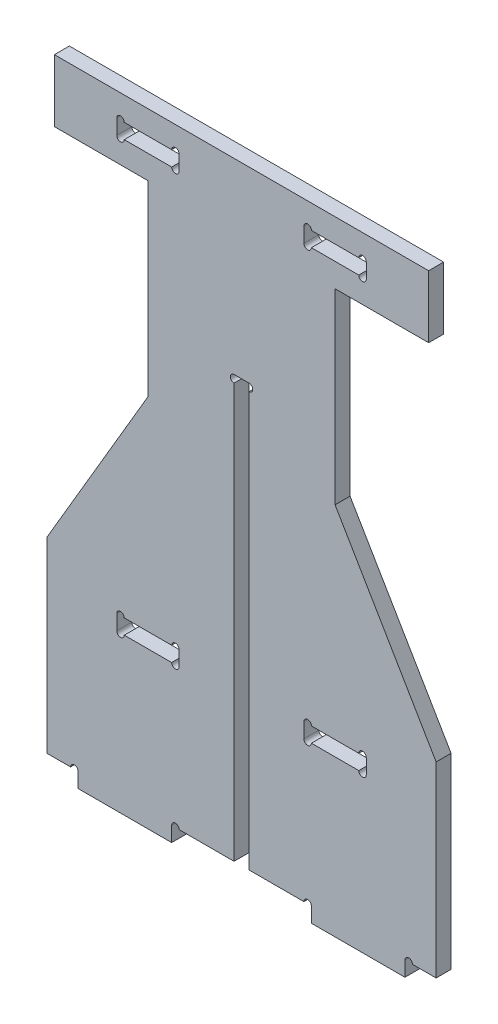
ISO-10303-21;
HEADER;
FILE_DESCRIPTION(('STEP AP214'),'2;1');
FILE_NAME('part.step','',(''),(''),'','','');
FILE_SCHEMA(('AUTOMOTIVE_DESIGN { 1 0 10303 214 1 1 1 1 }'));
ENDSEC;
DATA;
#1=APPLICATION_CONTEXT('core data for automotive mechanical design processes');
#2=APPLICATION_PROTOCOL_DEFINITION('international standard','automotive_design',2000,#1);
#3=PRODUCT_CONTEXT('',#1,'mechanical');
#4=PRODUCT('Part','Part','',(#3));
#5=PRODUCT_RELATED_PRODUCT_CATEGORY('part','',(#4));
#6=PRODUCT_DEFINITION_FORMATION('','',#4);
#7=PRODUCT_DEFINITION_CONTEXT('part definition',#1,'design');
#8=PRODUCT_DEFINITION('design','',#6,#7);
#9=PRODUCT_DEFINITION_SHAPE('','',#8);
#10=(LENGTH_UNIT() NAMED_UNIT(*) SI_UNIT(.MILLI.,.METRE.));
#11=(NAMED_UNIT(*) PLANE_ANGLE_UNIT() SI_UNIT($,.RADIAN.));
#12=(NAMED_UNIT(*) SI_UNIT($,.STERADIAN.) SOLID_ANGLE_UNIT());
#13=UNCERTAINTY_MEASURE_WITH_UNIT(LENGTH_MEASURE(1.E-05),#10,'distance_accuracy_value','');
#14=(GEOMETRIC_REPRESENTATION_CONTEXT(3) GLOBAL_UNCERTAINTY_ASSIGNED_CONTEXT((#13)) GLOBAL_UNIT_ASSIGNED_CONTEXT((#10,
#11,#12)) REPRESENTATION_CONTEXT('',''));
#15=CARTESIAN_POINT('',(0.,0.,0.));
#16=DIRECTION('',(0.,0.,1.));
#17=DIRECTION('',(1.,0.,0.));
#18=AXIS2_PLACEMENT_3D('',#15,#16,#17);
#19=CARTESIAN_POINT('',(134.,-488.,-12.));
#20=DIRECTION('',(0.,0.,-1.));
#21=DIRECTION('',(-1.,0.,0.));
#22=AXIS2_PLACEMENT_3D('',#19,#20,#21);
#23=PLANE('',#22);
#24=DIRECTION('',(0.,-1.,0.));
#25=VECTOR('',#24,1.);
#26=CARTESIAN_POINT('',(150.,0.,-12.));
#27=LINE('',#26,#25);
#28=CARTESIAN_POINT('',(150.,0.,-12.));
#29=VERTEX_POINT('',#28);
#30=CARTESIAN_POINT('',(150.,-50.,-12.));
#31=VERTEX_POINT('',#30);
#32=EDGE_CURVE('E668',#29,#31,#27,.T.);
#33=ORIENTED_EDGE('',*,*,#32,.T.);
#34=DIRECTION('',(-1.,0.,0.));
#35=VECTOR('',#34,1.);
#36=CARTESIAN_POINT('',(150.,-50.,-12.));
#37=LINE('',#36,#35);
#38=CARTESIAN_POINT('',(75.,-50.,-12.));
#39=VERTEX_POINT('',#38);
#40=EDGE_CURVE('E671',#31,#39,#37,.T.);
#41=ORIENTED_EDGE('',*,*,#40,.T.);
#42=DIRECTION('',(0.,-1.,0.));
#43=VECTOR('',#42,1.);
#44=CARTESIAN_POINT('',(75.,-50.,-12.));
#45=LINE('',#44,#43);
#46=CARTESIAN_POINT('',(75.,-200.,-12.));
#47=VERTEX_POINT('',#46);
#48=EDGE_CURVE('E674',#39,#47,#45,.T.);
#49=ORIENTED_EDGE('',*,*,#48,.T.);
#50=DIRECTION('',(0.506200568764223,-0.862415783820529,0.));
#51=VECTOR('',#50,1.);
#52=CARTESIAN_POINT('',(75.,-200.,-12.));
#53=LINE('',#52,#51);
#54=CARTESIAN_POINT('',(156.,-338.,-12.));
#55=VERTEX_POINT('',#54);
#56=EDGE_CURVE('E676',#47,#55,#53,.T.);
#57=ORIENTED_EDGE('',*,*,#56,.T.);
#58=DIRECTION('',(0.,-1.,0.));
#59=VECTOR('',#58,1.);
#60=CARTESIAN_POINT('',(156.,-338.,-12.));
#61=LINE('',#60,#59);
#62=CARTESIAN_POINT('',(156.,-488.,-12.));
#63=VERTEX_POINT('',#62);
#64=EDGE_CURVE('E678',#55,#63,#61,.T.);
#65=ORIENTED_EDGE('',*,*,#64,.T.);
#66=DIRECTION('',(-1.,0.,0.));
#67=VECTOR('',#66,1.);
#68=CARTESIAN_POINT('',(156.,-488.,-12.));
#69=LINE('',#68,#67);
#70=CARTESIAN_POINT('',(137.,-488.,-12.));
#71=VERTEX_POINT('',#70);
#72=EDGE_CURVE('E680',#63,#71,#69,.T.);
#73=ORIENTED_EDGE('',*,*,#72,.T.);
#74=CARTESIAN_POINT('',(134.,-488.,-12.));
#75=DIRECTION('',(0.,0.,1.));
#76=DIRECTION('',(-1.,0.,0.));
#77=AXIS2_PLACEMENT_3D('',#74,#75,#76);
#78=CIRCLE('',#77,2.99999999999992);
#79=CARTESIAN_POINT('',(131.,-488.,-12.));
#80=VERTEX_POINT('',#79);
#81=EDGE_CURVE('E682',#71,#80,#78,.T.);
#82=ORIENTED_EDGE('',*,*,#81,.T.);
#83=DIRECTION('',(0.,-1.,0.));
#84=VECTOR('',#83,1.);
#85=CARTESIAN_POINT('',(131.,-488.,-12.));
#86=LINE('',#85,#84);
#87=CARTESIAN_POINT('',(131.,-500.,-12.));
#88=VERTEX_POINT('',#87);
#89=EDGE_CURVE('E684',#80,#88,#86,.T.);
#90=ORIENTED_EDGE('',*,*,#89,.T.);
#91=DIRECTION('',(-1.,0.,0.));
#92=VECTOR('',#91,1.);
#93=CARTESIAN_POINT('',(131.,-500.,-12.));
#94=LINE('',#93,#92);
#95=CARTESIAN_POINT('',(56.,-500.,-12.));
#96=VERTEX_POINT('',#95);
#97=EDGE_CURVE('E686',#88,#96,#94,.T.);
#98=ORIENTED_EDGE('',*,*,#97,.T.);
#99=DIRECTION('',(0.,1.,0.));
#100=VECTOR('',#99,1.);
#101=CARTESIAN_POINT('',(56.,-500.,-12.));
#102=LINE('',#101,#100);
#103=CARTESIAN_POINT('',(55.9999999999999,-488.,-12.));
#104=VERTEX_POINT('',#103);
#105=EDGE_CURVE('E688',#96,#104,#102,.T.);
#106=ORIENTED_EDGE('',*,*,#105,.T.);
#107=CARTESIAN_POINT('',(52.9999999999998,-488.,-12.));
#108=DIRECTION('',(0.,0.,1.));
#109=DIRECTION('',(-1.,0.,0.));
#110=AXIS2_PLACEMENT_3D('',#107,#108,#109);
#111=CIRCLE('',#110,3.0000000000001);
#112=CARTESIAN_POINT('',(49.9999999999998,-488.,-12.));
#113=VERTEX_POINT('',#112);
#114=EDGE_CURVE('E690',#104,#113,#111,.T.);
#115=ORIENTED_EDGE('',*,*,#114,.T.);
#116=DIRECTION('',(-1.,0.,0.));
#117=VECTOR('',#116,1.);
#118=CARTESIAN_POINT('',(49.9999999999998,-488.,-12.));
#119=LINE('',#118,#117);
#120=CARTESIAN_POINT('',(5.99999999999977,-488.,-12.));
#121=VERTEX_POINT('',#120);
#122=EDGE_CURVE('E692',#113,#121,#119,.T.);
#123=ORIENTED_EDGE('',*,*,#122,.T.);
#124=DIRECTION('',(0.,1.,0.));
#125=VECTOR('',#124,1.);
#126=CARTESIAN_POINT('',(5.99999999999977,-488.,-12.));
#127=LINE('',#126,#125);
#128=CARTESIAN_POINT('',(5.99999999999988,-156.,-12.));
#129=VERTEX_POINT('',#128);
#130=EDGE_CURVE('E694',#121,#129,#127,.T.);
#131=ORIENTED_EDGE('',*,*,#130,.T.);
#132=CARTESIAN_POINT('',(6.00000000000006,-153.,-12.));
#133=DIRECTION('',(0.,0.,1.));
#134=DIRECTION('',(-1.,0.,0.));
#135=AXIS2_PLACEMENT_3D('',#132,#133,#134);
#136=CIRCLE('',#135,3.);
#137=CARTESIAN_POINT('',(5.99999999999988,-150.,-12.));
#138=VERTEX_POINT('',#137);
#139=EDGE_CURVE('E696',#129,#138,#136,.T.);
#140=ORIENTED_EDGE('',*,*,#139,.T.);
#141=DIRECTION('',(-1.,0.,0.));
#142=VECTOR('',#141,1.);
#143=CARTESIAN_POINT('',(5.99999999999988,-150.,-12.));
#144=LINE('',#143,#142);
#145=CARTESIAN_POINT('',(-5.99999999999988,-150.,-12.));
#146=VERTEX_POINT('',#145);
#147=EDGE_CURVE('E698',#138,#146,#144,.T.);
#148=ORIENTED_EDGE('',*,*,#147,.T.);
#149=CARTESIAN_POINT('',(-5.99999999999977,-153.,-12.));
#150=DIRECTION('',(0.,0.,1.));
#151=DIRECTION('',(-1.,0.,0.));
#152=AXIS2_PLACEMENT_3D('',#149,#150,#151);
#153=CIRCLE('',#152,3.);
#154=CARTESIAN_POINT('',(-5.99999999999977,-156.,-12.));
#155=VERTEX_POINT('',#154);
#156=EDGE_CURVE('E700',#146,#155,#153,.T.);
#157=ORIENTED_EDGE('',*,*,#156,.T.);
#158=DIRECTION('',(0.,-1.,0.));
#159=VECTOR('',#158,1.);
#160=CARTESIAN_POINT('',(-5.99999999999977,-488.,-12.));
#161=LINE('',#160,#159);
#162=CARTESIAN_POINT('',(-5.99999999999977,-488.,-12.));
#163=VERTEX_POINT('',#162);
#164=EDGE_CURVE('E702',#155,#163,#161,.T.);
#165=ORIENTED_EDGE('',*,*,#164,.T.);
#166=DIRECTION('',(-1.,0.,0.));
#167=VECTOR('',#166,1.);
#168=CARTESIAN_POINT('',(-49.9999999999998,-488.,-12.));
#169=LINE('',#168,#167);
#170=CARTESIAN_POINT('',(-49.9999999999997,-488.,-12.));
#171=VERTEX_POINT('',#170);
#172=EDGE_CURVE('E704',#163,#171,#169,.T.);
#173=ORIENTED_EDGE('',*,*,#172,.T.);
#174=CARTESIAN_POINT('',(-52.9999999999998,-488.,-12.));
#175=DIRECTION('',(0.,0.,1.));
#176=DIRECTION('',(-1.,0.,0.));
#177=AXIS2_PLACEMENT_3D('',#174,#175,#176);
#178=CIRCLE('',#177,3.00000000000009);
#179=CARTESIAN_POINT('',(-56.,-488.,-12.));
#180=VERTEX_POINT('',#179);
#181=EDGE_CURVE('E706',#171,#180,#178,.T.);
#182=ORIENTED_EDGE('',*,*,#181,.T.);
#183=DIRECTION('',(0.,-1.,0.));
#184=VECTOR('',#183,1.);
#185=CARTESIAN_POINT('',(-56.,-500.,-12.));
#186=LINE('',#185,#184);
#187=CARTESIAN_POINT('',(-56.,-500.,-12.));
#188=VERTEX_POINT('',#187);
#189=EDGE_CURVE('E708',#180,#188,#186,.T.);
#190=ORIENTED_EDGE('',*,*,#189,.T.);
#191=DIRECTION('',(-1.,0.,0.));
#192=VECTOR('',#191,1.);
#193=CARTESIAN_POINT('',(-131.,-500.,-12.));
#194=LINE('',#193,#192);
#195=CARTESIAN_POINT('',(-131.,-500.,-12.));
#196=VERTEX_POINT('',#195);
#197=EDGE_CURVE('E710',#188,#196,#194,.T.);
#198=ORIENTED_EDGE('',*,*,#197,.T.);
#199=DIRECTION('',(0.,1.,0.));
#200=VECTOR('',#199,1.);
#201=CARTESIAN_POINT('',(-131.,-488.,-12.));
#202=LINE('',#201,#200);
#203=CARTESIAN_POINT('',(-131.,-488.,-12.));
#204=VERTEX_POINT('',#203);
#205=EDGE_CURVE('E712',#196,#204,#202,.T.);
#206=ORIENTED_EDGE('',*,*,#205,.T.);
#207=CARTESIAN_POINT('',(-134.,-488.,-12.));
#208=DIRECTION('',(0.,0.,1.));
#209=DIRECTION('',(-1.,0.,0.));
#210=AXIS2_PLACEMENT_3D('',#207,#208,#209);
#211=CIRCLE('',#210,2.99999999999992);
#212=CARTESIAN_POINT('',(-137.,-488.,-12.));
#213=VERTEX_POINT('',#212);
#214=EDGE_CURVE('E714',#204,#213,#211,.T.);
#215=ORIENTED_EDGE('',*,*,#214,.T.);
#216=DIRECTION('',(-1.,0.,0.));
#217=VECTOR('',#216,1.);
#218=CARTESIAN_POINT('',(-156.,-488.,-12.));
#219=LINE('',#218,#217);
#220=CARTESIAN_POINT('',(-156.,-488.,-12.));
#221=VERTEX_POINT('',#220);
#222=EDGE_CURVE('E716',#213,#221,#219,.T.);
#223=ORIENTED_EDGE('',*,*,#222,.T.);
#224=DIRECTION('',(0.,1.,0.));
#225=VECTOR('',#224,1.);
#226=CARTESIAN_POINT('',(-156.,-338.,-12.));
#227=LINE('',#226,#225);
#228=CARTESIAN_POINT('',(-156.,-338.,-12.));
#229=VERTEX_POINT('',#228);
#230=EDGE_CURVE('E718',#221,#229,#227,.T.);
#231=ORIENTED_EDGE('',*,*,#230,.T.);
#232=DIRECTION('',(0.506200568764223,0.862415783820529,0.));
#233=VECTOR('',#232,1.);
#234=CARTESIAN_POINT('',(-75.,-200.,-12.));
#235=LINE('',#234,#233);
#236=CARTESIAN_POINT('',(-75.,-200.,-12.));
#237=VERTEX_POINT('',#236);
#238=EDGE_CURVE('E720',#229,#237,#235,.T.);
#239=ORIENTED_EDGE('',*,*,#238,.T.);
#240=DIRECTION('',(0.,1.,0.));
#241=VECTOR('',#240,1.);
#242=CARTESIAN_POINT('',(-75.,-50.,-12.));
#243=LINE('',#242,#241);
#244=CARTESIAN_POINT('',(-75.,-50.,-12.));
#245=VERTEX_POINT('',#244);
#246=EDGE_CURVE('E722',#237,#245,#243,.T.);
#247=ORIENTED_EDGE('',*,*,#246,.T.);
#248=DIRECTION('',(-1.,0.,0.));
#249=VECTOR('',#248,1.);
#250=CARTESIAN_POINT('',(-150.,-50.,-12.));
#251=LINE('',#250,#249);
#252=CARTESIAN_POINT('',(-150.,-50.,-12.));
#253=VERTEX_POINT('',#252);
#254=EDGE_CURVE('E724',#245,#253,#251,.T.);
#255=ORIENTED_EDGE('',*,*,#254,.T.);
#256=DIRECTION('',(0.,1.,0.));
#257=VECTOR('',#256,1.);
#258=CARTESIAN_POINT('',(-150.,0.,-12.));
#259=LINE('',#258,#257);
#260=CARTESIAN_POINT('',(-150.,0.,-12.));
#261=VERTEX_POINT('',#260);
#262=EDGE_CURVE('E726',#253,#261,#259,.T.);
#263=ORIENTED_EDGE('',*,*,#262,.T.);
#264=DIRECTION('',(1.,0.,0.));
#265=VECTOR('',#264,1.);
#266=CARTESIAN_POINT('',(-150.,0.,-12.));
#267=LINE('',#266,#265);
#268=EDGE_CURVE('E728',#261,#29,#267,.T.);
#269=ORIENTED_EDGE('',*,*,#268,.T.);
#270=EDGE_LOOP('',(#33,#41,#49,#57,#65,#73,#82,#90,#98,#106,#115,#123,#131,#140,#148,#157,#165,
#173,#182,#190,#198,#206,#215,#223,#231,#239,#247,#255,#263,#269));
#271=FACE_BOUND('',#270,.T.);
#272=DIRECTION('',(1.,0.,0.));
#273=VECTOR('',#272,1.);
#274=CARTESIAN_POINT('',(56.,-19.,-12.));
#275=LINE('',#274,#273);
#276=CARTESIAN_POINT('',(56.,-19.,-12.));
#277=VERTEX_POINT('',#276);
#278=CARTESIAN_POINT('',(94.,-19.,-12.));
#279=VERTEX_POINT('',#278);
#280=EDGE_CURVE('E611',#277,#279,#275,.T.);
#281=ORIENTED_EDGE('',*,*,#280,.F.);
#282=CARTESIAN_POINT('',(53.,-19.,-12.));
#283=DIRECTION('',(0.,0.,-1.));
#284=DIRECTION('',(-1.,0.,0.));
#285=AXIS2_PLACEMENT_3D('',#282,#283,#284);
#286=CIRCLE('',#285,3.);
#287=CARTESIAN_POINT('',(50.,-19.,-12.));
#288=VERTEX_POINT('',#287);
#289=EDGE_CURVE('E609',#288,#277,#286,.T.);
#290=ORIENTED_EDGE('',*,*,#289,.F.);
#291=DIRECTION('',(0.,1.,0.));
#292=VECTOR('',#291,1.);
#293=CARTESIAN_POINT('',(50.,-31.,-12.));
#294=LINE('',#293,#292);
#295=CARTESIAN_POINT('',(50.,-31.,-12.));
#296=VERTEX_POINT('',#295);
#297=EDGE_CURVE('E625',#296,#288,#294,.T.);
#298=ORIENTED_EDGE('',*,*,#297,.F.);
#299=CARTESIAN_POINT('',(53.,-31.,-12.));
#300=DIRECTION('',(0.,0.,-1.));
#301=DIRECTION('',(-1.,0.,0.));
#302=AXIS2_PLACEMENT_3D('',#299,#300,#301);
#303=CIRCLE('',#302,3.);
#304=CARTESIAN_POINT('',(56.,-31.,-12.));
#305=VERTEX_POINT('',#304);
#306=EDGE_CURVE('E622',#305,#296,#303,.T.);
#307=ORIENTED_EDGE('',*,*,#306,.F.);
#308=DIRECTION('',(-1.,0.,0.));
#309=VECTOR('',#308,1.);
#310=CARTESIAN_POINT('',(56.,-31.,-12.));
#311=LINE('',#310,#309);
#312=CARTESIAN_POINT('',(94.,-31.,-12.));
#313=VERTEX_POINT('',#312);
#314=EDGE_CURVE('E620',#313,#305,#311,.T.);
#315=ORIENTED_EDGE('',*,*,#314,.F.);
#316=CARTESIAN_POINT('',(97.,-31.,-12.));
#317=DIRECTION('',(0.,0.,-1.));
#318=DIRECTION('',(-1.,0.,0.));
#319=AXIS2_PLACEMENT_3D('',#316,#317,#318);
#320=CIRCLE('',#319,3.);
#321=CARTESIAN_POINT('',(100.,-31.,-12.));
#322=VERTEX_POINT('',#321);
#323=EDGE_CURVE('E618',#322,#313,#320,.T.);
#324=ORIENTED_EDGE('',*,*,#323,.F.);
#325=DIRECTION('',(0.,-1.,0.));
#326=VECTOR('',#325,1.);
#327=CARTESIAN_POINT('',(100.,-31.,-12.));
#328=LINE('',#327,#326);
#329=CARTESIAN_POINT('',(100.,-19.,-12.));
#330=VERTEX_POINT('',#329);
#331=EDGE_CURVE('E616',#330,#322,#328,.T.);
#332=ORIENTED_EDGE('',*,*,#331,.F.);
#333=CARTESIAN_POINT('',(97.,-19.,-12.));
#334=DIRECTION('',(0.,0.,-1.));
#335=DIRECTION('',(-1.,0.,0.));
#336=AXIS2_PLACEMENT_3D('',#333,#334,#335);
#337=CIRCLE('',#336,3.);
#338=EDGE_CURVE('E614',#279,#330,#337,.T.);
#339=ORIENTED_EDGE('',*,*,#338,.F.);
#340=EDGE_LOOP('',(#281,#290,#298,#307,#315,#324,#332,#339));
#341=FACE_BOUND('',#340,.T.);
#342=DIRECTION('',(0.,1.,0.));
#343=VECTOR('',#342,1.);
#344=CARTESIAN_POINT('',(50.,-375.,-12.));
#345=LINE('',#344,#343);
#346=CARTESIAN_POINT('',(50.,-375.,-12.));
#347=VERTEX_POINT('',#346);
#348=CARTESIAN_POINT('',(50.,-363.,-12.));
#349=VERTEX_POINT('',#348);
#350=EDGE_CURVE('E552',#347,#349,#345,.T.);
#351=ORIENTED_EDGE('',*,*,#350,.F.);
#352=CARTESIAN_POINT('',(53.,-375.,-12.));
#353=DIRECTION('',(0.,0.,-1.));
#354=DIRECTION('',(-1.,0.,0.));
#355=AXIS2_PLACEMENT_3D('',#352,#353,#354);
#356=CIRCLE('',#355,3.00000000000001);
#357=CARTESIAN_POINT('',(56.,-375.,-12.));
#358=VERTEX_POINT('',#357);
#359=EDGE_CURVE('E550',#358,#347,#356,.T.);
#360=ORIENTED_EDGE('',*,*,#359,.F.);
#361=DIRECTION('',(-1.,0.,0.));
#362=VECTOR('',#361,1.);
#363=CARTESIAN_POINT('',(56.,-375.,-12.));
#364=LINE('',#363,#362);
#365=CARTESIAN_POINT('',(94.,-375.,-12.));
#366=VERTEX_POINT('',#365);
#367=EDGE_CURVE('E566',#366,#358,#364,.T.);
#368=ORIENTED_EDGE('',*,*,#367,.F.);
#369=CARTESIAN_POINT('',(97.,-375.,-12.));
#370=DIRECTION('',(0.,0.,-1.));
#371=DIRECTION('',(-1.,0.,0.));
#372=AXIS2_PLACEMENT_3D('',#369,#370,#371);
#373=CIRCLE('',#372,3.00000000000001);
#374=CARTESIAN_POINT('',(100.,-375.,-12.));
#375=VERTEX_POINT('',#374);
#376=EDGE_CURVE('E563',#375,#366,#373,.T.);
#377=ORIENTED_EDGE('',*,*,#376,.F.);
#378=DIRECTION('',(0.,-1.,0.));
#379=VECTOR('',#378,1.);
#380=CARTESIAN_POINT('',(100.,-375.,-12.));
#381=LINE('',#380,#379);
#382=CARTESIAN_POINT('',(100.,-363.,-12.));
#383=VERTEX_POINT('',#382);
#384=EDGE_CURVE('E561',#383,#375,#381,.T.);
#385=ORIENTED_EDGE('',*,*,#384,.F.);
#386=CARTESIAN_POINT('',(97.,-363.,-12.));
#387=DIRECTION('',(0.,0.,-1.));
#388=DIRECTION('',(-1.,0.,0.));
#389=AXIS2_PLACEMENT_3D('',#386,#387,#388);
#390=CIRCLE('',#389,3.);
#391=CARTESIAN_POINT('',(94.,-363.,-12.));
#392=VERTEX_POINT('',#391);
#393=EDGE_CURVE('E559',#392,#383,#390,.T.);
#394=ORIENTED_EDGE('',*,*,#393,.F.);
#395=DIRECTION('',(1.,0.,0.));
#396=VECTOR('',#395,1.);
#397=CARTESIAN_POINT('',(56.,-363.,-12.));
#398=LINE('',#397,#396);
#399=CARTESIAN_POINT('',(56.,-363.,-12.));
#400=VERTEX_POINT('',#399);
#401=EDGE_CURVE('E557',#400,#392,#398,.T.);
#402=ORIENTED_EDGE('',*,*,#401,.F.);
#403=CARTESIAN_POINT('',(53.,-363.,-12.));
#404=DIRECTION('',(0.,0.,-1.));
#405=DIRECTION('',(-1.,0.,0.));
#406=AXIS2_PLACEMENT_3D('',#403,#404,#405);
#407=CIRCLE('',#406,3.00000000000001);
#408=EDGE_CURVE('E555',#349,#400,#407,.T.);
#409=ORIENTED_EDGE('',*,*,#408,.F.);
#410=EDGE_LOOP('',(#351,#360,#368,#377,#385,#394,#402,#409));
#411=FACE_BOUND('',#410,.T.);
#412=DIRECTION('',(-1.,0.,0.));
#413=VECTOR('',#412,1.);
#414=CARTESIAN_POINT('',(-56.,-375.,-12.));
#415=LINE('',#414,#413);
#416=CARTESIAN_POINT('',(-56.,-375.,-12.));
#417=VERTEX_POINT('',#416);
#418=CARTESIAN_POINT('',(-94.,-375.,-12.));
#419=VERTEX_POINT('',#418);
#420=EDGE_CURVE('E493',#417,#419,#415,.T.);
#421=ORIENTED_EDGE('',*,*,#420,.F.);
#422=CARTESIAN_POINT('',(-53.,-375.,-12.));
#423=DIRECTION('',(0.,0.,-1.));
#424=DIRECTION('',(1.,0.,0.));
#425=AXIS2_PLACEMENT_3D('',#422,#423,#424);
#426=CIRCLE('',#425,3.00000000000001);
#427=CARTESIAN_POINT('',(-50.,-375.,-12.));
#428=VERTEX_POINT('',#427);
#429=EDGE_CURVE('E491',#428,#417,#426,.T.);
#430=ORIENTED_EDGE('',*,*,#429,.F.);
#431=DIRECTION('',(0.,-1.,0.));
#432=VECTOR('',#431,1.);
#433=CARTESIAN_POINT('',(-50.,-375.,-12.));
#434=LINE('',#433,#432);
#435=CARTESIAN_POINT('',(-50.,-363.,-12.));
#436=VERTEX_POINT('',#435);
#437=EDGE_CURVE('E507',#436,#428,#434,.T.);
#438=ORIENTED_EDGE('',*,*,#437,.F.);
#439=CARTESIAN_POINT('',(-53.,-363.,-12.));
#440=DIRECTION('',(0.,0.,-1.));
#441=DIRECTION('',(1.,0.,0.));
#442=AXIS2_PLACEMENT_3D('',#439,#440,#441);
#443=CIRCLE('',#442,3.00000000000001);
#444=CARTESIAN_POINT('',(-56.,-363.,-12.));
#445=VERTEX_POINT('',#444);
#446=EDGE_CURVE('E504',#445,#436,#443,.T.);
#447=ORIENTED_EDGE('',*,*,#446,.F.);
#448=DIRECTION('',(1.,0.,0.));
#449=VECTOR('',#448,1.);
#450=CARTESIAN_POINT('',(-56.,-363.,-12.));
#451=LINE('',#450,#449);
#452=CARTESIAN_POINT('',(-94.,-363.,-12.));
#453=VERTEX_POINT('',#452);
#454=EDGE_CURVE('E502',#453,#445,#451,.T.);
#455=ORIENTED_EDGE('',*,*,#454,.F.);
#456=CARTESIAN_POINT('',(-97.,-363.,-12.));
#457=DIRECTION('',(0.,0.,-1.));
#458=DIRECTION('',(1.,0.,0.));
#459=AXIS2_PLACEMENT_3D('',#456,#457,#458);
#460=CIRCLE('',#459,3.);
#461=CARTESIAN_POINT('',(-100.,-363.,-12.));
#462=VERTEX_POINT('',#461);
#463=EDGE_CURVE('E500',#462,#453,#460,.T.);
#464=ORIENTED_EDGE('',*,*,#463,.F.);
#465=DIRECTION('',(0.,1.,0.));
#466=VECTOR('',#465,1.);
#467=CARTESIAN_POINT('',(-100.,-375.,-12.));
#468=LINE('',#467,#466);
#469=CARTESIAN_POINT('',(-100.,-375.,-12.));
#470=VERTEX_POINT('',#469);
#471=EDGE_CURVE('E498',#470,#462,#468,.T.);
#472=ORIENTED_EDGE('',*,*,#471,.F.);
#473=CARTESIAN_POINT('',(-97.,-375.,-12.));
#474=DIRECTION('',(0.,0.,-1.));
#475=DIRECTION('',(1.,0.,0.));
#476=AXIS2_PLACEMENT_3D('',#473,#474,#475);
#477=CIRCLE('',#476,3.00000000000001);
#478=EDGE_CURVE('E496',#419,#470,#477,.T.);
#479=ORIENTED_EDGE('',*,*,#478,.F.);
#480=EDGE_LOOP('',(#421,#430,#438,#447,#455,#464,#472,#479));
#481=FACE_BOUND('',#480,.T.);
#482=DIRECTION('',(-1.,0.,0.));
#483=VECTOR('',#482,1.);
#484=CARTESIAN_POINT('',(-56.,-31.,-12.));
#485=LINE('',#484,#483);
#486=CARTESIAN_POINT('',(-56.,-31.,-12.));
#487=VERTEX_POINT('',#486);
#488=CARTESIAN_POINT('',(-94.,-31.,-12.));
#489=VERTEX_POINT('',#488);
#490=EDGE_CURVE('E434',#487,#489,#485,.T.);
#491=ORIENTED_EDGE('',*,*,#490,.F.);
#492=CARTESIAN_POINT('',(-53.,-31.,-12.));
#493=DIRECTION('',(0.,0.,-1.));
#494=DIRECTION('',(1.,0.,0.));
#495=AXIS2_PLACEMENT_3D('',#492,#493,#494);
#496=CIRCLE('',#495,3.);
#497=CARTESIAN_POINT('',(-50.,-31.,-12.));
#498=VERTEX_POINT('',#497);
#499=EDGE_CURVE('E426',#498,#487,#496,.T.);
#500=ORIENTED_EDGE('',*,*,#499,.F.);
#501=DIRECTION('',(0.,-1.,0.));
#502=VECTOR('',#501,1.);
#503=CARTESIAN_POINT('',(-50.,-31.,-12.));
#504=LINE('',#503,#502);
#505=CARTESIAN_POINT('',(-50.,-19.,-12.));
#506=VERTEX_POINT('',#505);
#507=EDGE_CURVE('E459',#506,#498,#504,.T.);
#508=ORIENTED_EDGE('',*,*,#507,.F.);
#509=CARTESIAN_POINT('',(-53.,-19.,-12.));
#510=DIRECTION('',(0.,0.,-1.));
#511=DIRECTION('',(1.,0.,0.));
#512=AXIS2_PLACEMENT_3D('',#509,#510,#511);
#513=CIRCLE('',#512,3.);
#514=CARTESIAN_POINT('',(-56.,-19.,-12.));
#515=VERTEX_POINT('',#514);
#516=EDGE_CURVE('E457',#515,#506,#513,.T.);
#517=ORIENTED_EDGE('',*,*,#516,.F.);
#518=DIRECTION('',(1.,0.,0.));
#519=VECTOR('',#518,1.);
#520=CARTESIAN_POINT('',(-56.,-19.,-12.));
#521=LINE('',#520,#519);
#522=CARTESIAN_POINT('',(-94.,-19.,-12.));
#523=VERTEX_POINT('',#522);
#524=EDGE_CURVE('E455',#523,#515,#521,.T.);
#525=ORIENTED_EDGE('',*,*,#524,.F.);
#526=CARTESIAN_POINT('',(-97.,-19.,-12.));
#527=DIRECTION('',(0.,0.,-1.));
#528=DIRECTION('',(1.,0.,0.));
#529=AXIS2_PLACEMENT_3D('',#526,#527,#528);
#530=CIRCLE('',#529,3.);
#531=CARTESIAN_POINT('',(-100.,-19.,-12.));
#532=VERTEX_POINT('',#531);
#533=EDGE_CURVE('E453',#532,#523,#530,.T.);
#534=ORIENTED_EDGE('',*,*,#533,.F.);
#535=DIRECTION('',(0.,1.,0.));
#536=VECTOR('',#535,1.);
#537=CARTESIAN_POINT('',(-100.,-31.,-12.));
#538=LINE('',#537,#536);
#539=CARTESIAN_POINT('',(-100.,-31.,-12.));
#540=VERTEX_POINT('',#539);
#541=EDGE_CURVE('E449',#540,#532,#538,.T.);
#542=ORIENTED_EDGE('',*,*,#541,.F.);
#543=CARTESIAN_POINT('',(-97.,-31.,-12.));
#544=DIRECTION('',(0.,0.,-1.));
#545=DIRECTION('',(1.,0.,0.));
#546=AXIS2_PLACEMENT_3D('',#543,#544,#545);
#547=CIRCLE('',#546,3.);
#548=EDGE_CURVE('E447',#489,#540,#547,.T.);
#549=ORIENTED_EDGE('',*,*,#548,.F.);
#550=EDGE_LOOP('',(#491,#500,#508,#517,#525,#534,#542,#549));
#551=FACE_BOUND('',#550,.T.);
#552=ADVANCED_FACE('F37',(#271,#341,#411,#481,#551),#23,.T.);
#553=CARTESIAN_POINT('',(134.,-488.,0.));
#554=DIRECTION('',(0.,0.,-1.));
#555=DIRECTION('',(-1.,0.,0.));
#556=AXIS2_PLACEMENT_3D('',#553,#554,#555);
#557=PLANE('',#556);
#558=CARTESIAN_POINT('',(-53.,-375.,0.));
#559=DIRECTION('',(0.,0.,-1.));
#560=DIRECTION('',(1.,0.,0.));
#561=AXIS2_PLACEMENT_3D('',#558,#559,#560);
#562=CIRCLE('',#561,3.00000000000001);
#563=CARTESIAN_POINT('',(-50.,-375.,0.));
#564=VERTEX_POINT('',#563);
#565=CARTESIAN_POINT('',(-56.,-375.,0.));
#566=VERTEX_POINT('',#565);
#567=EDGE_CURVE('E442',#564,#566,#562,.T.);
#568=ORIENTED_EDGE('',*,*,#567,.T.);
#569=DIRECTION('',(-1.,0.,0.));
#570=VECTOR('',#569,1.);
#571=CARTESIAN_POINT('',(-56.,-375.,0.));
#572=LINE('',#571,#570);
#573=CARTESIAN_POINT('',(-94.,-375.,0.));
#574=VERTEX_POINT('',#573);
#575=EDGE_CURVE('E512',#566,#574,#572,.T.);
#576=ORIENTED_EDGE('',*,*,#575,.T.);
#577=CARTESIAN_POINT('',(-97.,-375.,0.));
#578=DIRECTION('',(0.,0.,-1.));
#579=DIRECTION('',(1.,0.,0.));
#580=AXIS2_PLACEMENT_3D('',#577,#578,#579);
#581=CIRCLE('',#580,3.00000000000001);
#582=CARTESIAN_POINT('',(-100.,-375.,0.));
#583=VERTEX_POINT('',#582);
#584=EDGE_CURVE('E515',#574,#583,#581,.T.);
#585=ORIENTED_EDGE('',*,*,#584,.T.);
#586=DIRECTION('',(0.,1.,0.));
#587=VECTOR('',#586,1.);
#588=CARTESIAN_POINT('',(-100.,-375.,0.));
#589=LINE('',#588,#587);
#590=CARTESIAN_POINT('',(-100.,-363.,0.));
#591=VERTEX_POINT('',#590);
#592=EDGE_CURVE('E518',#583,#591,#589,.T.);
#593=ORIENTED_EDGE('',*,*,#592,.T.);
#594=CARTESIAN_POINT('',(-97.,-363.,0.));
#595=DIRECTION('',(0.,0.,-1.));
#596=DIRECTION('',(1.,0.,0.));
#597=AXIS2_PLACEMENT_3D('',#594,#595,#596);
#598=CIRCLE('',#597,3.);
#599=CARTESIAN_POINT('',(-94.,-363.,0.));
#600=VERTEX_POINT('',#599);
#601=EDGE_CURVE('E521',#591,#600,#598,.T.);
#602=ORIENTED_EDGE('',*,*,#601,.T.);
#603=DIRECTION('',(1.,0.,0.));
#604=VECTOR('',#603,1.);
#605=CARTESIAN_POINT('',(-56.,-363.,0.));
#606=LINE('',#605,#604);
#607=CARTESIAN_POINT('',(-56.,-363.,0.));
#608=VERTEX_POINT('',#607);
#609=EDGE_CURVE('E524',#600,#608,#606,.T.);
#610=ORIENTED_EDGE('',*,*,#609,.T.);
#611=CARTESIAN_POINT('',(-53.,-363.,0.));
#612=DIRECTION('',(0.,0.,-1.));
#613=DIRECTION('',(1.,0.,0.));
#614=AXIS2_PLACEMENT_3D('',#611,#612,#613);
#615=CIRCLE('',#614,3.00000000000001);
#616=CARTESIAN_POINT('',(-50.,-363.,0.));
#617=VERTEX_POINT('',#616);
#618=EDGE_CURVE('E527',#608,#617,#615,.T.);
#619=ORIENTED_EDGE('',*,*,#618,.T.);
#620=DIRECTION('',(0.,-1.,0.));
#621=VECTOR('',#620,1.);
#622=CARTESIAN_POINT('',(-50.,-375.,0.));
#623=LINE('',#622,#621);
#624=EDGE_CURVE('E494',#617,#564,#623,.T.);
#625=ORIENTED_EDGE('',*,*,#624,.T.);
#626=EDGE_LOOP('',(#568,#576,#585,#593,#602,#610,#619,#625));
#627=FACE_BOUND('',#626,.T.);
#628=CARTESIAN_POINT('',(53.,-19.,0.));
#629=DIRECTION('',(0.,0.,-1.));
#630=DIRECTION('',(-1.,0.,0.));
#631=AXIS2_PLACEMENT_3D('',#628,#629,#630);
#632=CIRCLE('',#631,3.);
#633=CARTESIAN_POINT('',(50.,-19.,0.));
#634=VERTEX_POINT('',#633);
#635=CARTESIAN_POINT('',(56.,-19.,0.));
#636=VERTEX_POINT('',#635);
#637=EDGE_CURVE('E608',#634,#636,#632,.T.);
#638=ORIENTED_EDGE('',*,*,#637,.T.);
#639=DIRECTION('',(1.,0.,0.));
#640=VECTOR('',#639,1.);
#641=CARTESIAN_POINT('',(56.,-19.,0.));
#642=LINE('',#641,#640);
#643=CARTESIAN_POINT('',(94.,-19.,0.));
#644=VERTEX_POINT('',#643);
#645=EDGE_CURVE('E630',#636,#644,#642,.T.);
#646=ORIENTED_EDGE('',*,*,#645,.T.);
#647=CARTESIAN_POINT('',(97.,-19.,0.));
#648=DIRECTION('',(0.,0.,-1.));
#649=DIRECTION('',(-1.,0.,0.));
#650=AXIS2_PLACEMENT_3D('',#647,#648,#649);
#651=CIRCLE('',#650,3.);
#652=CARTESIAN_POINT('',(100.,-19.,0.));
#653=VERTEX_POINT('',#652);
#654=EDGE_CURVE('E633',#644,#653,#651,.T.);
#655=ORIENTED_EDGE('',*,*,#654,.T.);
#656=DIRECTION('',(0.,-1.,0.));
#657=VECTOR('',#656,1.);
#658=CARTESIAN_POINT('',(100.,-31.,0.));
#659=LINE('',#658,#657);
#660=CARTESIAN_POINT('',(100.,-31.,0.));
#661=VERTEX_POINT('',#660);
#662=EDGE_CURVE('E636',#653,#661,#659,.T.);
#663=ORIENTED_EDGE('',*,*,#662,.T.);
#664=CARTESIAN_POINT('',(97.,-31.,0.));
#665=DIRECTION('',(0.,0.,-1.));
#666=DIRECTION('',(-1.,0.,0.));
#667=AXIS2_PLACEMENT_3D('',#664,#665,#666);
#668=CIRCLE('',#667,3.);
#669=CARTESIAN_POINT('',(94.,-31.,0.));
#670=VERTEX_POINT('',#669);
#671=EDGE_CURVE('E639',#661,#670,#668,.T.);
#672=ORIENTED_EDGE('',*,*,#671,.T.);
#673=DIRECTION('',(-1.,0.,0.));
#674=VECTOR('',#673,1.);
#675=CARTESIAN_POINT('',(56.,-31.,0.));
#676=LINE('',#675,#674);
#677=CARTESIAN_POINT('',(56.,-31.,0.));
#678=VERTEX_POINT('',#677);
#679=EDGE_CURVE('E642',#670,#678,#676,.T.);
#680=ORIENTED_EDGE('',*,*,#679,.T.);
#681=CARTESIAN_POINT('',(53.,-31.,0.));
#682=DIRECTION('',(0.,0.,-1.));
#683=DIRECTION('',(-1.,0.,0.));
#684=AXIS2_PLACEMENT_3D('',#681,#682,#683);
#685=CIRCLE('',#684,3.);
#686=CARTESIAN_POINT('',(50.,-31.,0.));
#687=VERTEX_POINT('',#686);
#688=EDGE_CURVE('E645',#678,#687,#685,.T.);
#689=ORIENTED_EDGE('',*,*,#688,.T.);
#690=DIRECTION('',(0.,1.,0.));
#691=VECTOR('',#690,1.);
#692=CARTESIAN_POINT('',(50.,-31.,0.));
#693=LINE('',#692,#691);
#694=EDGE_CURVE('E612',#687,#634,#693,.T.);
#695=ORIENTED_EDGE('',*,*,#694,.T.);
#696=EDGE_LOOP('',(#638,#646,#655,#663,#672,#680,#689,#695));
#697=FACE_BOUND('',#696,.T.);
#698=DIRECTION('',(0.,-1.,0.));
#699=VECTOR('',#698,1.);
#700=CARTESIAN_POINT('',(150.,0.,0.));
#701=LINE('',#700,#699);
#702=CARTESIAN_POINT('',(150.,0.,0.));
#703=VERTEX_POINT('',#702);
#704=CARTESIAN_POINT('',(150.,-50.,0.));
#705=VERTEX_POINT('',#704);
#706=EDGE_CURVE('E667',#703,#705,#701,.T.);
#707=ORIENTED_EDGE('',*,*,#706,.F.);
#708=DIRECTION('',(1.,0.,0.));
#709=VECTOR('',#708,1.);
#710=CARTESIAN_POINT('',(-150.,0.,0.));
#711=LINE('',#710,#709);
#712=CARTESIAN_POINT('',(-150.,0.,0.));
#713=VERTEX_POINT('',#712);
#714=EDGE_CURVE('E672',#713,#703,#711,.T.);
#715=ORIENTED_EDGE('',*,*,#714,.F.);
#716=DIRECTION('',(0.,1.,0.));
#717=VECTOR('',#716,1.);
#718=CARTESIAN_POINT('',(-150.,0.,0.));
#719=LINE('',#718,#717);
#720=CARTESIAN_POINT('',(-150.,-50.,0.));
#721=VERTEX_POINT('',#720);
#722=EDGE_CURVE('E787',#721,#713,#719,.T.);
#723=ORIENTED_EDGE('',*,*,#722,.F.);
#724=DIRECTION('',(-1.,0.,0.));
#725=VECTOR('',#724,1.);
#726=CARTESIAN_POINT('',(-150.,-50.,0.));
#727=LINE('',#726,#725);
#728=CARTESIAN_POINT('',(-75.,-50.,0.));
#729=VERTEX_POINT('',#728);
#730=EDGE_CURVE('E785',#729,#721,#727,.T.);
#731=ORIENTED_EDGE('',*,*,#730,.F.);
#732=DIRECTION('',(0.,1.,0.));
#733=VECTOR('',#732,1.);
#734=CARTESIAN_POINT('',(-75.,-50.,0.));
#735=LINE('',#734,#733);
#736=CARTESIAN_POINT('',(-75.,-200.,0.));
#737=VERTEX_POINT('',#736);
#738=EDGE_CURVE('E783',#737,#729,#735,.T.);
#739=ORIENTED_EDGE('',*,*,#738,.F.);
#740=DIRECTION('',(0.506200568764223,0.862415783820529,0.));
#741=VECTOR('',#740,1.);
#742=CARTESIAN_POINT('',(-75.,-200.,0.));
#743=LINE('',#742,#741);
#744=CARTESIAN_POINT('',(-156.,-338.,0.));
#745=VERTEX_POINT('',#744);
#746=EDGE_CURVE('E781',#745,#737,#743,.T.);
#747=ORIENTED_EDGE('',*,*,#746,.F.);
#748=DIRECTION('',(0.,1.,0.));
#749=VECTOR('',#748,1.);
#750=CARTESIAN_POINT('',(-156.,-338.,0.));
#751=LINE('',#750,#749);
#752=CARTESIAN_POINT('',(-156.,-488.,0.));
#753=VERTEX_POINT('',#752);
#754=EDGE_CURVE('E779',#753,#745,#751,.T.);
#755=ORIENTED_EDGE('',*,*,#754,.F.);
#756=DIRECTION('',(-1.,0.,0.));
#757=VECTOR('',#756,1.);
#758=CARTESIAN_POINT('',(-156.,-488.,0.));
#759=LINE('',#758,#757);
#760=CARTESIAN_POINT('',(-137.,-488.,0.));
#761=VERTEX_POINT('',#760);
#762=EDGE_CURVE('E777',#761,#753,#759,.T.);
#763=ORIENTED_EDGE('',*,*,#762,.F.);
#764=CARTESIAN_POINT('',(-134.,-488.,0.));
#765=DIRECTION('',(0.,0.,1.));
#766=DIRECTION('',(-1.,0.,0.));
#767=AXIS2_PLACEMENT_3D('',#764,#765,#766);
#768=CIRCLE('',#767,2.99999999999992);
#769=CARTESIAN_POINT('',(-131.,-488.,0.));
#770=VERTEX_POINT('',#769);
#771=EDGE_CURVE('E775',#770,#761,#768,.T.);
#772=ORIENTED_EDGE('',*,*,#771,.F.);
#773=DIRECTION('',(0.,1.,0.));
#774=VECTOR('',#773,1.);
#775=CARTESIAN_POINT('',(-131.,-488.,0.));
#776=LINE('',#775,#774);
#777=CARTESIAN_POINT('',(-131.,-500.,0.));
#778=VERTEX_POINT('',#777);
#779=EDGE_CURVE('E773',#778,#770,#776,.T.);
#780=ORIENTED_EDGE('',*,*,#779,.F.);
#781=DIRECTION('',(-1.,0.,0.));
#782=VECTOR('',#781,1.);
#783=CARTESIAN_POINT('',(-131.,-500.,0.));
#784=LINE('',#783,#782);
#785=CARTESIAN_POINT('',(-56.,-500.,0.));
#786=VERTEX_POINT('',#785);
#787=EDGE_CURVE('E771',#786,#778,#784,.T.);
#788=ORIENTED_EDGE('',*,*,#787,.F.);
#789=DIRECTION('',(0.,-1.,0.));
#790=VECTOR('',#789,1.);
#791=CARTESIAN_POINT('',(-56.,-500.,0.));
#792=LINE('',#791,#790);
#793=CARTESIAN_POINT('',(-56.,-488.,0.));
#794=VERTEX_POINT('',#793);
#795=EDGE_CURVE('E769',#794,#786,#792,.T.);
#796=ORIENTED_EDGE('',*,*,#795,.F.);
#797=CARTESIAN_POINT('',(-52.9999999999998,-488.,0.));
#798=DIRECTION('',(0.,0.,1.));
#799=DIRECTION('',(-1.,0.,0.));
#800=AXIS2_PLACEMENT_3D('',#797,#798,#799);
#801=CIRCLE('',#800,3.00000000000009);
#802=CARTESIAN_POINT('',(-49.9999999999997,-488.,0.));
#803=VERTEX_POINT('',#802);
#804=EDGE_CURVE('E767',#803,#794,#801,.T.);
#805=ORIENTED_EDGE('',*,*,#804,.F.);
#806=DIRECTION('',(-1.,0.,0.));
#807=VECTOR('',#806,1.);
#808=CARTESIAN_POINT('',(-49.9999999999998,-488.,0.));
#809=LINE('',#808,#807);
#810=CARTESIAN_POINT('',(-5.99999999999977,-488.,0.));
#811=VERTEX_POINT('',#810);
#812=EDGE_CURVE('E765',#811,#803,#809,.T.);
#813=ORIENTED_EDGE('',*,*,#812,.F.);
#814=DIRECTION('',(0.,-1.,0.));
#815=VECTOR('',#814,1.);
#816=CARTESIAN_POINT('',(-5.99999999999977,-488.,0.));
#817=LINE('',#816,#815);
#818=CARTESIAN_POINT('',(-5.99999999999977,-156.,0.));
#819=VERTEX_POINT('',#818);
#820=EDGE_CURVE('E763',#819,#811,#817,.T.);
#821=ORIENTED_EDGE('',*,*,#820,.F.);
#822=CARTESIAN_POINT('',(-5.99999999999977,-153.,0.));
#823=DIRECTION('',(0.,0.,1.));
#824=DIRECTION('',(-1.,0.,0.));
#825=AXIS2_PLACEMENT_3D('',#822,#823,#824);
#826=CIRCLE('',#825,3.);
#827=CARTESIAN_POINT('',(-5.99999999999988,-150.,0.));
#828=VERTEX_POINT('',#827);
#829=EDGE_CURVE('E761',#828,#819,#826,.T.);
#830=ORIENTED_EDGE('',*,*,#829,.F.);
#831=DIRECTION('',(-1.,0.,0.));
#832=VECTOR('',#831,1.);
#833=CARTESIAN_POINT('',(5.99999999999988,-150.,0.));
#834=LINE('',#833,#832);
#835=CARTESIAN_POINT('',(5.99999999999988,-150.,0.));
#836=VERTEX_POINT('',#835);
#837=EDGE_CURVE('E759',#836,#828,#834,.T.);
#838=ORIENTED_EDGE('',*,*,#837,.F.);
#839=CARTESIAN_POINT('',(6.00000000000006,-153.,0.));
#840=DIRECTION('',(0.,0.,1.));
#841=DIRECTION('',(-1.,0.,0.));
#842=AXIS2_PLACEMENT_3D('',#839,#840,#841);
#843=CIRCLE('',#842,3.);
#844=CARTESIAN_POINT('',(5.99999999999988,-156.,0.));
#845=VERTEX_POINT('',#844);
#846=EDGE_CURVE('E757',#845,#836,#843,.T.);
#847=ORIENTED_EDGE('',*,*,#846,.F.);
#848=DIRECTION('',(0.,1.,0.));
#849=VECTOR('',#848,1.);
#850=CARTESIAN_POINT('',(5.99999999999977,-488.,0.));
#851=LINE('',#850,#849);
#852=CARTESIAN_POINT('',(5.99999999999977,-488.,0.));
#853=VERTEX_POINT('',#852);
#854=EDGE_CURVE('E755',#853,#845,#851,.T.);
#855=ORIENTED_EDGE('',*,*,#854,.F.);
#856=DIRECTION('',(-1.,0.,0.));
#857=VECTOR('',#856,1.);
#858=CARTESIAN_POINT('',(49.9999999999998,-488.,0.));
#859=LINE('',#858,#857);
#860=CARTESIAN_POINT('',(49.9999999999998,-488.,0.));
#861=VERTEX_POINT('',#860);
#862=EDGE_CURVE('E753',#861,#853,#859,.T.);
#863=ORIENTED_EDGE('',*,*,#862,.F.);
#864=CARTESIAN_POINT('',(52.9999999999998,-488.,0.));
#865=DIRECTION('',(0.,0.,1.));
#866=DIRECTION('',(-1.,0.,0.));
#867=AXIS2_PLACEMENT_3D('',#864,#865,#866);
#868=CIRCLE('',#867,3.0000000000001);
#869=CARTESIAN_POINT('',(55.9999999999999,-488.,0.));
#870=VERTEX_POINT('',#869);
#871=EDGE_CURVE('E751',#870,#861,#868,.T.);
#872=ORIENTED_EDGE('',*,*,#871,.F.);
#873=DIRECTION('',(0.,1.,0.));
#874=VECTOR('',#873,1.);
#875=CARTESIAN_POINT('',(56.,-500.,0.));
#876=LINE('',#875,#874);
#877=CARTESIAN_POINT('',(56.,-500.,0.));
#878=VERTEX_POINT('',#877);
#879=EDGE_CURVE('E749',#878,#870,#876,.T.);
#880=ORIENTED_EDGE('',*,*,#879,.F.);
#881=DIRECTION('',(-1.,0.,0.));
#882=VECTOR('',#881,1.);
#883=CARTESIAN_POINT('',(131.,-500.,0.));
#884=LINE('',#883,#882);
#885=CARTESIAN_POINT('',(131.,-500.,0.));
#886=VERTEX_POINT('',#885);
#887=EDGE_CURVE('E747',#886,#878,#884,.T.);
#888=ORIENTED_EDGE('',*,*,#887,.F.);
#889=DIRECTION('',(0.,-1.,0.));
#890=VECTOR('',#889,1.);
#891=CARTESIAN_POINT('',(131.,-488.,0.));
#892=LINE('',#891,#890);
#893=CARTESIAN_POINT('',(131.,-488.,0.));
#894=VERTEX_POINT('',#893);
#895=EDGE_CURVE('E745',#894,#886,#892,.T.);
#896=ORIENTED_EDGE('',*,*,#895,.F.);
#897=CARTESIAN_POINT('',(134.,-488.,0.));
#898=DIRECTION('',(0.,0.,1.));
#899=DIRECTION('',(-1.,0.,0.));
#900=AXIS2_PLACEMENT_3D('',#897,#898,#899);
#901=CIRCLE('',#900,2.99999999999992);
#902=CARTESIAN_POINT('',(137.,-488.,0.));
#903=VERTEX_POINT('',#902);
#904=EDGE_CURVE('E743',#903,#894,#901,.T.);
#905=ORIENTED_EDGE('',*,*,#904,.F.);
#906=DIRECTION('',(-1.,0.,0.));
#907=VECTOR('',#906,1.);
#908=CARTESIAN_POINT('',(156.,-488.,0.));
#909=LINE('',#908,#907);
#910=CARTESIAN_POINT('',(156.,-488.,0.));
#911=VERTEX_POINT('',#910);
#912=EDGE_CURVE('E741',#911,#903,#909,.T.);
#913=ORIENTED_EDGE('',*,*,#912,.F.);
#914=DIRECTION('',(0.,-1.,0.));
#915=VECTOR('',#914,1.);
#916=CARTESIAN_POINT('',(156.,-338.,0.));
#917=LINE('',#916,#915);
#918=CARTESIAN_POINT('',(156.,-338.,0.));
#919=VERTEX_POINT('',#918);
#920=EDGE_CURVE('E739',#919,#911,#917,.T.);
#921=ORIENTED_EDGE('',*,*,#920,.F.);
#922=DIRECTION('',(0.506200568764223,-0.862415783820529,0.));
#923=VECTOR('',#922,1.);
#924=CARTESIAN_POINT('',(75.,-200.,0.));
#925=LINE('',#924,#923);
#926=CARTESIAN_POINT('',(75.,-200.,0.));
#927=VERTEX_POINT('',#926);
#928=EDGE_CURVE('E737',#927,#919,#925,.T.);
#929=ORIENTED_EDGE('',*,*,#928,.F.);
#930=DIRECTION('',(0.,-1.,0.));
#931=VECTOR('',#930,1.);
#932=CARTESIAN_POINT('',(75.,-50.,0.));
#933=LINE('',#932,#931);
#934=CARTESIAN_POINT('',(75.,-50.,0.));
#935=VERTEX_POINT('',#934);
#936=EDGE_CURVE('E735',#935,#927,#933,.T.);
#937=ORIENTED_EDGE('',*,*,#936,.F.);
#938=DIRECTION('',(-1.,0.,0.));
#939=VECTOR('',#938,1.);
#940=CARTESIAN_POINT('',(150.,-50.,0.));
#941=LINE('',#940,#939);
#942=EDGE_CURVE('E733',#705,#935,#941,.T.);
#943=ORIENTED_EDGE('',*,*,#942,.F.);
#944=EDGE_LOOP('',(#707,#715,#723,#731,#739,#747,#755,#763,#772,#780,#788,#796,#805,#813,#821,
#830,#838,#847,#855,#863,#872,#880,#888,#896,#905,#913,#921,#929,#937,#943));
#945=FACE_BOUND('',#944,.T.);
#946=CARTESIAN_POINT('',(53.,-375.,0.));
#947=DIRECTION('',(0.,0.,-1.));
#948=DIRECTION('',(-1.,0.,0.));
#949=AXIS2_PLACEMENT_3D('',#946,#947,#948);
#950=CIRCLE('',#949,3.00000000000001);
#951=CARTESIAN_POINT('',(56.,-375.,0.));
#952=VERTEX_POINT('',#951);
#953=CARTESIAN_POINT('',(50.,-375.,0.));
#954=VERTEX_POINT('',#953);
#955=EDGE_CURVE('E549',#952,#954,#950,.T.);
#956=ORIENTED_EDGE('',*,*,#955,.T.);
#957=DIRECTION('',(0.,1.,0.));
#958=VECTOR('',#957,1.);
#959=CARTESIAN_POINT('',(50.,-375.,0.));
#960=LINE('',#959,#958);
#961=CARTESIAN_POINT('',(50.,-363.,0.));
#962=VERTEX_POINT('',#961);
#963=EDGE_CURVE('E571',#954,#962,#960,.T.);
#964=ORIENTED_EDGE('',*,*,#963,.T.);
#965=CARTESIAN_POINT('',(53.,-363.,0.));
#966=DIRECTION('',(0.,0.,-1.));
#967=DIRECTION('',(-1.,0.,0.));
#968=AXIS2_PLACEMENT_3D('',#965,#966,#967);
#969=CIRCLE('',#968,3.00000000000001);
#970=CARTESIAN_POINT('',(56.,-363.,0.));
#971=VERTEX_POINT('',#970);
#972=EDGE_CURVE('E574',#962,#971,#969,.T.);
#973=ORIENTED_EDGE('',*,*,#972,.T.);
#974=DIRECTION('',(1.,0.,0.));
#975=VECTOR('',#974,1.);
#976=CARTESIAN_POINT('',(56.,-363.,0.));
#977=LINE('',#976,#975);
#978=CARTESIAN_POINT('',(94.,-363.,0.));
#979=VERTEX_POINT('',#978);
#980=EDGE_CURVE('E577',#971,#979,#977,.T.);
#981=ORIENTED_EDGE('',*,*,#980,.T.);
#982=CARTESIAN_POINT('',(97.,-363.,0.));
#983=DIRECTION('',(0.,0.,-1.));
#984=DIRECTION('',(-1.,0.,0.));
#985=AXIS2_PLACEMENT_3D('',#982,#983,#984);
#986=CIRCLE('',#985,3.);
#987=CARTESIAN_POINT('',(100.,-363.,0.));
#988=VERTEX_POINT('',#987);
#989=EDGE_CURVE('E580',#979,#988,#986,.T.);
#990=ORIENTED_EDGE('',*,*,#989,.T.);
#991=DIRECTION('',(0.,-1.,0.));
#992=VECTOR('',#991,1.);
#993=CARTESIAN_POINT('',(100.,-375.,0.));
#994=LINE('',#993,#992);
#995=CARTESIAN_POINT('',(100.,-375.,0.));
#996=VERTEX_POINT('',#995);
#997=EDGE_CURVE('E583',#988,#996,#994,.T.);
#998=ORIENTED_EDGE('',*,*,#997,.T.);
#999=CARTESIAN_POINT('',(97.,-375.,0.));
#1000=DIRECTION('',(0.,0.,-1.));
#1001=DIRECTION('',(-1.,0.,0.));
#1002=AXIS2_PLACEMENT_3D('',#999,#1000,#1001);
#1003=CIRCLE('',#1002,3.00000000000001);
#1004=CARTESIAN_POINT('',(94.,-375.,0.));
#1005=VERTEX_POINT('',#1004);
#1006=EDGE_CURVE('E586',#996,#1005,#1003,.T.);
#1007=ORIENTED_EDGE('',*,*,#1006,.T.);
#1008=DIRECTION('',(-1.,0.,0.));
#1009=VECTOR('',#1008,1.);
#1010=CARTESIAN_POINT('',(56.,-375.,0.));
#1011=LINE('',#1010,#1009);
#1012=EDGE_CURVE('E553',#1005,#952,#1011,.T.);
#1013=ORIENTED_EDGE('',*,*,#1012,.T.);
#1014=EDGE_LOOP('',(#956,#964,#973,#981,#990,#998,#1007,#1013));
#1015=FACE_BOUND('',#1014,.T.);
#1016=CARTESIAN_POINT('',(-53.,-31.,0.));
#1017=DIRECTION('',(0.,0.,-1.));
#1018=DIRECTION('',(1.,0.,0.));
#1019=AXIS2_PLACEMENT_3D('',#1016,#1017,#1018);
#1020=CIRCLE('',#1019,3.);
#1021=CARTESIAN_POINT('',(-50.,-31.,0.));
#1022=VERTEX_POINT('',#1021);
#1023=CARTESIAN_POINT('',(-56.,-31.,0.));
#1024=VERTEX_POINT('',#1023);
#1025=EDGE_CURVE('E60',#1022,#1024,#1020,.T.);
#1026=ORIENTED_EDGE('',*,*,#1025,.T.);
#1027=DIRECTION('',(-1.,0.,0.));
#1028=VECTOR('',#1027,1.);
#1029=CARTESIAN_POINT('',(-56.,-31.,0.));
#1030=LINE('',#1029,#1028);
#1031=CARTESIAN_POINT('',(-94.,-31.,0.));
#1032=VERTEX_POINT('',#1031);
#1033=EDGE_CURVE('E441',#1024,#1032,#1030,.T.);
#1034=ORIENTED_EDGE('',*,*,#1033,.T.);
#1035=CARTESIAN_POINT('',(-97.,-31.,0.));
#1036=DIRECTION('',(0.,0.,-1.));
#1037=DIRECTION('',(1.,0.,0.));
#1038=AXIS2_PLACEMENT_3D('',#1035,#1036,#1037);
#1039=CIRCLE('',#1038,3.);
#1040=CARTESIAN_POINT('',(-100.,-31.,0.));
#1041=VERTEX_POINT('',#1040);
#1042=EDGE_CURVE('E463',#1032,#1041,#1039,.T.);
#1043=ORIENTED_EDGE('',*,*,#1042,.T.);
#1044=DIRECTION('',(0.,1.,0.));
#1045=VECTOR('',#1044,1.);
#1046=CARTESIAN_POINT('',(-100.,-31.,0.));
#1047=LINE('',#1046,#1045);
#1048=CARTESIAN_POINT('',(-100.,-19.,0.));
#1049=VERTEX_POINT('',#1048);
#1050=EDGE_CURVE('E466',#1041,#1049,#1047,.T.);
#1051=ORIENTED_EDGE('',*,*,#1050,.T.);
#1052=CARTESIAN_POINT('',(-97.,-19.,0.));
#1053=DIRECTION('',(0.,0.,-1.));
#1054=DIRECTION('',(1.,0.,0.));
#1055=AXIS2_PLACEMENT_3D('',#1052,#1053,#1054);
#1056=CIRCLE('',#1055,3.);
#1057=CARTESIAN_POINT('',(-94.,-19.,0.));
#1058=VERTEX_POINT('',#1057);
#1059=EDGE_CURVE('E469',#1049,#1058,#1056,.T.);
#1060=ORIENTED_EDGE('',*,*,#1059,.T.);
#1061=DIRECTION('',(1.,0.,0.));
#1062=VECTOR('',#1061,1.);
#1063=CARTESIAN_POINT('',(-56.,-19.,0.));
#1064=LINE('',#1063,#1062);
#1065=CARTESIAN_POINT('',(-56.,-19.,0.));
#1066=VERTEX_POINT('',#1065);
#1067=EDGE_CURVE('E472',#1058,#1066,#1064,.T.);
#1068=ORIENTED_EDGE('',*,*,#1067,.T.);
#1069=CARTESIAN_POINT('',(-53.,-19.,0.));
#1070=DIRECTION('',(0.,0.,-1.));
#1071=DIRECTION('',(1.,0.,0.));
#1072=AXIS2_PLACEMENT_3D('',#1069,#1070,#1071);
#1073=CIRCLE('',#1072,3.);
#1074=CARTESIAN_POINT('',(-50.,-19.,0.));
#1075=VERTEX_POINT('',#1074);
#1076=EDGE_CURVE('E475',#1066,#1075,#1073,.T.);
#1077=ORIENTED_EDGE('',*,*,#1076,.T.);
#1078=DIRECTION('',(0.,-1.,0.));
#1079=VECTOR('',#1078,1.);
#1080=CARTESIAN_POINT('',(-50.,-31.,0.));
#1081=LINE('',#1080,#1079);
#1082=EDGE_CURVE('E435',#1075,#1022,#1081,.T.);
#1083=ORIENTED_EDGE('',*,*,#1082,.T.);
#1084=EDGE_LOOP('',(#1026,#1034,#1043,#1051,#1060,#1068,#1077,#1083));
#1085=FACE_BOUND('',#1084,.T.);
#1086=ADVANCED_FACE('F883',(#627,#697,#945,#1015,#1085),#557,.F.);
#1087=CARTESIAN_POINT('',(150.,0.,-12.));
#1088=DIRECTION('',(-1.,0.,0.));
#1089=DIRECTION('',(0.,0.,1.));
#1090=AXIS2_PLACEMENT_3D('',#1087,#1088,#1089);
#1091=PLANE('',#1090);
#1092=ORIENTED_EDGE('',*,*,#706,.T.);
#1093=DIRECTION('',(0.,0.,1.));
#1094=VECTOR('',#1093,1.);
#1095=CARTESIAN_POINT('',(150.,-50.,-12.));
#1096=LINE('',#1095,#1094);
#1097=EDGE_CURVE('E11',#31,#705,#1096,.T.);
#1098=ORIENTED_EDGE('',*,*,#1097,.F.);
#1099=ORIENTED_EDGE('',*,*,#32,.F.);
#1100=DIRECTION('',(0.,0.,1.));
#1101=VECTOR('',#1100,1.);
#1102=CARTESIAN_POINT('',(150.,0.,-12.));
#1103=LINE('',#1102,#1101);
#1104=EDGE_CURVE('E730',#29,#703,#1103,.T.);
#1105=ORIENTED_EDGE('',*,*,#1104,.T.);
#1106=EDGE_LOOP('',(#1092,#1098,#1099,#1105));
#1107=FACE_BOUND('',#1106,.T.);
#1108=ADVANCED_FACE('F39',(#1107),#1091,.F.);
#1109=CARTESIAN_POINT('',(150.,-50.,-12.));
#1110=DIRECTION('',(0.,1.,0.));
#1111=DIRECTION('',(0.,0.,1.));
#1112=AXIS2_PLACEMENT_3D('',#1109,#1110,#1111);
#1113=PLANE('',#1112);
#1114=ORIENTED_EDGE('',*,*,#942,.T.);
#1115=DIRECTION('',(0.,0.,1.));
#1116=VECTOR('',#1115,1.);
#1117=CARTESIAN_POINT('',(75.,-50.,-12.));
#1118=LINE('',#1117,#1116);
#1119=EDGE_CURVE('E45',#39,#935,#1118,.T.);
#1120=ORIENTED_EDGE('',*,*,#1119,.F.);
#1121=ORIENTED_EDGE('',*,*,#40,.F.);
#1122=ORIENTED_EDGE('',*,*,#1097,.T.);
#1123=EDGE_LOOP('',(#1114,#1120,#1121,#1122));
#1124=FACE_BOUND('',#1123,.T.);
#1125=ADVANCED_FACE('F901',(#1124),#1113,.F.);
#1126=CARTESIAN_POINT('',(75.,-50.,-12.));
#1127=DIRECTION('',(-1.,0.,0.));
#1128=DIRECTION('',(0.,0.,1.));
#1129=AXIS2_PLACEMENT_3D('',#1126,#1127,#1128);
#1130=PLANE('',#1129);
#1131=ORIENTED_EDGE('',*,*,#936,.T.);
#1132=DIRECTION('',(0.,0.,1.));
#1133=VECTOR('',#1132,1.);
#1134=CARTESIAN_POINT('',(75.,-200.,-12.));
#1135=LINE('',#1134,#1133);
#1136=EDGE_CURVE('E870',#47,#927,#1135,.T.);
#1137=ORIENTED_EDGE('',*,*,#1136,.F.);
#1138=ORIENTED_EDGE('',*,*,#48,.F.);
#1139=ORIENTED_EDGE('',*,*,#1119,.T.);
#1140=EDGE_LOOP('',(#1131,#1137,#1138,#1139));
#1141=FACE_BOUND('',#1140,.T.);
#1142=ADVANCED_FACE('F877',(#1141),#1130,.F.);
#1143=CARTESIAN_POINT('',(75.,-200.,-12.));
#1144=DIRECTION('',(-0.862415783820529,-0.506200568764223,0.));
#1145=DIRECTION('',(0.506200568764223,-0.862415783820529,0.));
#1146=AXIS2_PLACEMENT_3D('',#1143,#1144,#1145);
#1147=PLANE('',#1146);
#1148=ORIENTED_EDGE('',*,*,#928,.T.);
#1149=DIRECTION('',(0.,0.,1.));
#1150=VECTOR('',#1149,1.);
#1151=CARTESIAN_POINT('',(156.,-338.,-12.));
#1152=LINE('',#1151,#1150);
#1153=EDGE_CURVE('E867',#55,#919,#1152,.T.);
#1154=ORIENTED_EDGE('',*,*,#1153,.F.);
#1155=ORIENTED_EDGE('',*,*,#56,.F.);
#1156=ORIENTED_EDGE('',*,*,#1136,.T.);
#1157=EDGE_LOOP('',(#1148,#1154,#1155,#1156));
#1158=FACE_BOUND('',#1157,.T.);
#1159=ADVANCED_FACE('F889',(#1158),#1147,.F.);
#1160=CARTESIAN_POINT('',(156.,-338.,-12.));
#1161=DIRECTION('',(-1.,0.,0.));
#1162=DIRECTION('',(0.,0.,1.));
#1163=AXIS2_PLACEMENT_3D('',#1160,#1161,#1162);
#1164=PLANE('',#1163);
#1165=ORIENTED_EDGE('',*,*,#920,.T.);
#1166=DIRECTION('',(0.,0.,1.));
#1167=VECTOR('',#1166,1.);
#1168=CARTESIAN_POINT('',(156.,-488.,-12.));
#1169=LINE('',#1168,#1167);
#1170=EDGE_CURVE('E864',#63,#911,#1169,.T.);
#1171=ORIENTED_EDGE('',*,*,#1170,.F.);
#1172=ORIENTED_EDGE('',*,*,#64,.F.);
#1173=ORIENTED_EDGE('',*,*,#1153,.T.);
#1174=EDGE_LOOP('',(#1165,#1171,#1172,#1173));
#1175=FACE_BOUND('',#1174,.T.);
#1176=ADVANCED_FACE('F893',(#1175),#1164,.F.);
#1177=CARTESIAN_POINT('',(156.,-488.,-12.));
#1178=DIRECTION('',(0.,1.,0.));
#1179=DIRECTION('',(0.,0.,1.));
#1180=AXIS2_PLACEMENT_3D('',#1177,#1178,#1179);
#1181=PLANE('',#1180);
#1182=ORIENTED_EDGE('',*,*,#912,.T.);
#1183=DIRECTION('',(0.,0.,1.));
#1184=VECTOR('',#1183,1.);
#1185=CARTESIAN_POINT('',(137.,-488.,-12.));
#1186=LINE('',#1185,#1184);
#1187=EDGE_CURVE('E861',#71,#903,#1186,.T.);
#1188=ORIENTED_EDGE('',*,*,#1187,.F.);
#1189=ORIENTED_EDGE('',*,*,#72,.F.);
#1190=ORIENTED_EDGE('',*,*,#1170,.T.);
#1191=EDGE_LOOP('',(#1182,#1188,#1189,#1190));
#1192=FACE_BOUND('',#1191,.T.);
#1193=ADVANCED_FACE('F1024',(#1192),#1181,.F.);
#1194=CARTESIAN_POINT('',(134.,-488.,-12.));
#1195=DIRECTION('',(0.,0.,1.));
#1196=DIRECTION('',(1.,0.,0.));
#1197=AXIS2_PLACEMENT_3D('',#1194,#1195,#1196);
#1198=CYLINDRICAL_SURFACE('',#1197,2.99999999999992);
#1199=ORIENTED_EDGE('',*,*,#904,.T.);
#1200=DIRECTION('',(0.,0.,1.));
#1201=VECTOR('',#1200,1.);
#1202=CARTESIAN_POINT('',(131.,-488.,-12.));
#1203=LINE('',#1202,#1201);
#1204=EDGE_CURVE('E858',#80,#894,#1203,.T.);
#1205=ORIENTED_EDGE('',*,*,#1204,.F.);
#1206=ORIENTED_EDGE('',*,*,#81,.F.);
#1207=ORIENTED_EDGE('',*,*,#1187,.T.);
#1208=EDGE_LOOP('',(#1199,#1205,#1206,#1207));
#1209=FACE_BOUND('',#1208,.T.);
#1210=ADVANCED_FACE('F1022',(#1209),#1198,.F.);
#1211=CARTESIAN_POINT('',(131.,-488.,-12.));
#1212=DIRECTION('',(-1.,0.,0.));
#1213=DIRECTION('',(0.,0.,1.));
#1214=AXIS2_PLACEMENT_3D('',#1211,#1212,#1213);
#1215=PLANE('',#1214);
#1216=ORIENTED_EDGE('',*,*,#895,.T.);
#1217=DIRECTION('',(0.,0.,1.));
#1218=VECTOR('',#1217,1.);
#1219=CARTESIAN_POINT('',(131.,-500.,-12.));
#1220=LINE('',#1219,#1218);
#1221=EDGE_CURVE('E855',#88,#886,#1220,.T.);
#1222=ORIENTED_EDGE('',*,*,#1221,.F.);
#1223=ORIENTED_EDGE('',*,*,#89,.F.);
#1224=ORIENTED_EDGE('',*,*,#1204,.T.);
#1225=EDGE_LOOP('',(#1216,#1222,#1223,#1224));
#1226=FACE_BOUND('',#1225,.T.);
#1227=ADVANCED_FACE('F1018',(#1226),#1215,.F.);
#1228=CARTESIAN_POINT('',(131.,-500.,-12.));
#1229=DIRECTION('',(0.,1.,0.));
#1230=DIRECTION('',(0.,0.,1.));
#1231=AXIS2_PLACEMENT_3D('',#1228,#1229,#1230);
#1232=PLANE('',#1231);
#1233=ORIENTED_EDGE('',*,*,#887,.T.);
#1234=DIRECTION('',(0.,0.,1.));
#1235=VECTOR('',#1234,1.);
#1236=CARTESIAN_POINT('',(56.,-500.,-12.));
#1237=LINE('',#1236,#1235);
#1238=EDGE_CURVE('E852',#96,#878,#1237,.T.);
#1239=ORIENTED_EDGE('',*,*,#1238,.F.);
#1240=ORIENTED_EDGE('',*,*,#97,.F.);
#1241=ORIENTED_EDGE('',*,*,#1221,.T.);
#1242=EDGE_LOOP('',(#1233,#1239,#1240,#1241));
#1243=FACE_BOUND('',#1242,.T.);
#1244=ADVANCED_FACE('F1013',(#1243),#1232,.F.);
#1245=CARTESIAN_POINT('',(56.,-500.,-12.));
#1246=DIRECTION('',(1.,0.,0.));
#1247=DIRECTION('',(0.,1.,0.));
#1248=AXIS2_PLACEMENT_3D('',#1245,#1246,#1247);
#1249=PLANE('',#1248);
#1250=ORIENTED_EDGE('',*,*,#879,.T.);
#1251=DIRECTION('',(0.,0.,1.));
#1252=VECTOR('',#1251,1.);
#1253=CARTESIAN_POINT('',(55.9999999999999,-488.,-12.));
#1254=LINE('',#1253,#1252);
#1255=EDGE_CURVE('E849',#104,#870,#1254,.T.);
#1256=ORIENTED_EDGE('',*,*,#1255,.F.);
#1257=ORIENTED_EDGE('',*,*,#105,.F.);
#1258=ORIENTED_EDGE('',*,*,#1238,.T.);
#1259=EDGE_LOOP('',(#1250,#1256,#1257,#1258));
#1260=FACE_BOUND('',#1259,.T.);
#1261=ADVANCED_FACE('F1007',(#1260),#1249,.F.);
#1262=CARTESIAN_POINT('',(52.9999999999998,-488.,-12.));
#1263=DIRECTION('',(0.,0.,1.));
#1264=DIRECTION('',(1.,0.,0.));
#1265=AXIS2_PLACEMENT_3D('',#1262,#1263,#1264);
#1266=CYLINDRICAL_SURFACE('',#1265,3.0000000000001);
#1267=ORIENTED_EDGE('',*,*,#871,.T.);
#1268=DIRECTION('',(0.,0.,1.));
#1269=VECTOR('',#1268,1.);
#1270=CARTESIAN_POINT('',(49.9999999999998,-488.,-12.));
#1271=LINE('',#1270,#1269);
#1272=EDGE_CURVE('E846',#113,#861,#1271,.T.);
#1273=ORIENTED_EDGE('',*,*,#1272,.F.);
#1274=ORIENTED_EDGE('',*,*,#114,.F.);
#1275=ORIENTED_EDGE('',*,*,#1255,.T.);
#1276=EDGE_LOOP('',(#1267,#1273,#1274,#1275));
#1277=FACE_BOUND('',#1276,.T.);
#1278=ADVANCED_FACE('F1003',(#1277),#1266,.F.);
#1279=CARTESIAN_POINT('',(49.9999999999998,-488.,-12.));
#1280=DIRECTION('',(0.,1.,0.));
#1281=DIRECTION('',(0.,0.,1.));
#1282=AXIS2_PLACEMENT_3D('',#1279,#1280,#1281);
#1283=PLANE('',#1282);
#1284=ORIENTED_EDGE('',*,*,#862,.T.);
#1285=DIRECTION('',(0.,0.,1.));
#1286=VECTOR('',#1285,1.);
#1287=CARTESIAN_POINT('',(5.99999999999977,-488.,-12.));
#1288=LINE('',#1287,#1286);
#1289=EDGE_CURVE('E843',#121,#853,#1288,.T.);
#1290=ORIENTED_EDGE('',*,*,#1289,.F.);
#1291=ORIENTED_EDGE('',*,*,#122,.F.);
#1292=ORIENTED_EDGE('',*,*,#1272,.T.);
#1293=EDGE_LOOP('',(#1284,#1290,#1291,#1292));
#1294=FACE_BOUND('',#1293,.T.);
#1295=ADVANCED_FACE('F998',(#1294),#1283,.F.);
#1296=CARTESIAN_POINT('',(5.99999999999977,-488.,-12.));
#1297=DIRECTION('',(1.,0.,0.));
#1298=DIRECTION('',(0.,1.,0.));
#1299=AXIS2_PLACEMENT_3D('',#1296,#1297,#1298);
#1300=PLANE('',#1299);
#1301=ORIENTED_EDGE('',*,*,#854,.T.);
#1302=DIRECTION('',(0.,0.,1.));
#1303=VECTOR('',#1302,1.);
#1304=CARTESIAN_POINT('',(5.99999999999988,-156.,-12.));
#1305=LINE('',#1304,#1303);
#1306=EDGE_CURVE('E840',#129,#845,#1305,.T.);
#1307=ORIENTED_EDGE('',*,*,#1306,.F.);
#1308=ORIENTED_EDGE('',*,*,#130,.F.);
#1309=ORIENTED_EDGE('',*,*,#1289,.T.);
#1310=EDGE_LOOP('',(#1301,#1307,#1308,#1309));
#1311=FACE_BOUND('',#1310,.T.);
#1312=ADVANCED_FACE('F992',(#1311),#1300,.F.);
#1313=CARTESIAN_POINT('',(6.00000000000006,-153.,-12.));
#1314=DIRECTION('',(0.,0.,1.));
#1315=DIRECTION('',(1.,0.,0.));
#1316=AXIS2_PLACEMENT_3D('',#1313,#1314,#1315);
#1317=CYLINDRICAL_SURFACE('',#1316,3.);
#1318=ORIENTED_EDGE('',*,*,#846,.T.);
#1319=DIRECTION('',(0.,0.,1.));
#1320=VECTOR('',#1319,1.);
#1321=CARTESIAN_POINT('',(5.99999999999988,-150.,-12.));
#1322=LINE('',#1321,#1320);
#1323=EDGE_CURVE('E837',#138,#836,#1322,.T.);
#1324=ORIENTED_EDGE('',*,*,#1323,.F.);
#1325=ORIENTED_EDGE('',*,*,#139,.F.);
#1326=ORIENTED_EDGE('',*,*,#1306,.T.);
#1327=EDGE_LOOP('',(#1318,#1324,#1325,#1326));
#1328=FACE_BOUND('',#1327,.T.);
#1329=ADVANCED_FACE('F988',(#1328),#1317,.F.);
#1330=CARTESIAN_POINT('',(5.99999999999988,-150.,-12.));
#1331=DIRECTION('',(0.,1.,0.));
#1332=DIRECTION('',(0.,0.,1.));
#1333=AXIS2_PLACEMENT_3D('',#1330,#1331,#1332);
#1334=PLANE('',#1333);
#1335=ORIENTED_EDGE('',*,*,#837,.T.);
#1336=DIRECTION('',(0.,0.,1.));
#1337=VECTOR('',#1336,1.);
#1338=CARTESIAN_POINT('',(-5.99999999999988,-150.,-12.));
#1339=LINE('',#1338,#1337);
#1340=EDGE_CURVE('E834',#146,#828,#1339,.T.);
#1341=ORIENTED_EDGE('',*,*,#1340,.F.);
#1342=ORIENTED_EDGE('',*,*,#147,.F.);
#1343=ORIENTED_EDGE('',*,*,#1323,.T.);
#1344=EDGE_LOOP('',(#1335,#1341,#1342,#1343));
#1345=FACE_BOUND('',#1344,.T.);
#1346=ADVANCED_FACE('F983',(#1345),#1334,.F.);
#1347=CARTESIAN_POINT('',(-5.99999999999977,-153.,-12.));
#1348=DIRECTION('',(0.,0.,1.));
#1349=DIRECTION('',(1.,0.,0.));
#1350=AXIS2_PLACEMENT_3D('',#1347,#1348,#1349);
#1351=CYLINDRICAL_SURFACE('',#1350,3.);
#1352=ORIENTED_EDGE('',*,*,#829,.T.);
#1353=DIRECTION('',(0.,0.,1.));
#1354=VECTOR('',#1353,1.);
#1355=CARTESIAN_POINT('',(-5.99999999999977,-156.,-12.));
#1356=LINE('',#1355,#1354);
#1357=EDGE_CURVE('E831',#155,#819,#1356,.T.);
#1358=ORIENTED_EDGE('',*,*,#1357,.F.);
#1359=ORIENTED_EDGE('',*,*,#156,.F.);
#1360=ORIENTED_EDGE('',*,*,#1340,.T.);
#1361=EDGE_LOOP('',(#1352,#1358,#1359,#1360));
#1362=FACE_BOUND('',#1361,.T.);
#1363=ADVANCED_FACE('F977',(#1362),#1351,.F.);
#1364=CARTESIAN_POINT('',(-5.99999999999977,-488.,-12.));
#1365=DIRECTION('',(-1.,0.,0.));
#1366=DIRECTION('',(0.,-1.,0.));
#1367=AXIS2_PLACEMENT_3D('',#1364,#1365,#1366);
#1368=PLANE('',#1367);
#1369=ORIENTED_EDGE('',*,*,#820,.T.);
#1370=DIRECTION('',(0.,0.,1.));
#1371=VECTOR('',#1370,1.);
#1372=CARTESIAN_POINT('',(-5.99999999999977,-488.,-12.));
#1373=LINE('',#1372,#1371);
#1374=EDGE_CURVE('E828',#163,#811,#1373,.T.);
#1375=ORIENTED_EDGE('',*,*,#1374,.F.);
#1376=ORIENTED_EDGE('',*,*,#164,.F.);
#1377=ORIENTED_EDGE('',*,*,#1357,.T.);
#1378=EDGE_LOOP('',(#1369,#1375,#1376,#1377));
#1379=FACE_BOUND('',#1378,.T.);
#1380=ADVANCED_FACE('F973',(#1379),#1368,.F.);
#1381=CARTESIAN_POINT('',(-49.9999999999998,-488.,-12.));
#1382=DIRECTION('',(0.,1.,0.));
#1383=DIRECTION('',(0.,0.,1.));
#1384=AXIS2_PLACEMENT_3D('',#1381,#1382,#1383);
#1385=PLANE('',#1384);
#1386=ORIENTED_EDGE('',*,*,#812,.T.);
#1387=DIRECTION('',(0.,0.,1.));
#1388=VECTOR('',#1387,1.);
#1389=CARTESIAN_POINT('',(-49.9999999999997,-488.,-12.));
#1390=LINE('',#1389,#1388);
#1391=EDGE_CURVE('E825',#171,#803,#1390,.T.);
#1392=ORIENTED_EDGE('',*,*,#1391,.F.);
#1393=ORIENTED_EDGE('',*,*,#172,.F.);
#1394=ORIENTED_EDGE('',*,*,#1374,.T.);
#1395=EDGE_LOOP('',(#1386,#1392,#1393,#1394));
#1396=FACE_BOUND('',#1395,.T.);
#1397=ADVANCED_FACE('F968',(#1396),#1385,.F.);
#1398=CARTESIAN_POINT('',(-52.9999999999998,-488.,-12.));
#1399=DIRECTION('',(0.,0.,1.));
#1400=DIRECTION('',(1.,0.,0.));
#1401=AXIS2_PLACEMENT_3D('',#1398,#1399,#1400);
#1402=CYLINDRICAL_SURFACE('',#1401,3.00000000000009);
#1403=ORIENTED_EDGE('',*,*,#804,.T.);
#1404=DIRECTION('',(0.,0.,1.));
#1405=VECTOR('',#1404,1.);
#1406=CARTESIAN_POINT('',(-56.,-488.,-12.));
#1407=LINE('',#1406,#1405);
#1408=EDGE_CURVE('E822',#180,#794,#1407,.T.);
#1409=ORIENTED_EDGE('',*,*,#1408,.F.);
#1410=ORIENTED_EDGE('',*,*,#181,.F.);
#1411=ORIENTED_EDGE('',*,*,#1391,.T.);
#1412=EDGE_LOOP('',(#1403,#1409,#1410,#1411));
#1413=FACE_BOUND('',#1412,.T.);
#1414=ADVANCED_FACE('F962',(#1413),#1402,.F.);
#1415=CARTESIAN_POINT('',(-56.,-500.,-12.));
#1416=DIRECTION('',(-1.,0.,0.));
#1417=DIRECTION('',(0.,-1.,0.));
#1418=AXIS2_PLACEMENT_3D('',#1415,#1416,#1417);
#1419=PLANE('',#1418);
#1420=ORIENTED_EDGE('',*,*,#795,.T.);
#1421=DIRECTION('',(0.,0.,1.));
#1422=VECTOR('',#1421,1.);
#1423=CARTESIAN_POINT('',(-56.,-500.,-12.));
#1424=LINE('',#1423,#1422);
#1425=EDGE_CURVE('E819',#188,#786,#1424,.T.);
#1426=ORIENTED_EDGE('',*,*,#1425,.F.);
#1427=ORIENTED_EDGE('',*,*,#189,.F.);
#1428=ORIENTED_EDGE('',*,*,#1408,.T.);
#1429=EDGE_LOOP('',(#1420,#1426,#1427,#1428));
#1430=FACE_BOUND('',#1429,.T.);
#1431=ADVANCED_FACE('F958',(#1430),#1419,.F.);
#1432=CARTESIAN_POINT('',(-131.,-500.,-12.));
#1433=DIRECTION('',(0.,1.,0.));
#1434=DIRECTION('',(-1.,0.,0.));
#1435=AXIS2_PLACEMENT_3D('',#1432,#1433,#1434);
#1436=PLANE('',#1435);
#1437=ORIENTED_EDGE('',*,*,#787,.T.);
#1438=DIRECTION('',(0.,0.,1.));
#1439=VECTOR('',#1438,1.);
#1440=CARTESIAN_POINT('',(-131.,-500.,-12.));
#1441=LINE('',#1440,#1439);
#1442=EDGE_CURVE('E816',#196,#778,#1441,.T.);
#1443=ORIENTED_EDGE('',*,*,#1442,.F.);
#1444=ORIENTED_EDGE('',*,*,#197,.F.);
#1445=ORIENTED_EDGE('',*,*,#1425,.T.);
#1446=EDGE_LOOP('',(#1437,#1443,#1444,#1445));
#1447=FACE_BOUND('',#1446,.T.);
#1448=ADVANCED_FACE('F953',(#1447),#1436,.F.);
#1449=CARTESIAN_POINT('',(-131.,-488.,-12.));
#1450=DIRECTION('',(1.,0.,0.));
#1451=DIRECTION('',(0.,0.,-1.));
#1452=AXIS2_PLACEMENT_3D('',#1449,#1450,#1451);
#1453=PLANE('',#1452);
#1454=ORIENTED_EDGE('',*,*,#779,.T.);
#1455=DIRECTION('',(0.,0.,1.));
#1456=VECTOR('',#1455,1.);
#1457=CARTESIAN_POINT('',(-131.,-488.,-12.));
#1458=LINE('',#1457,#1456);
#1459=EDGE_CURVE('E813',#204,#770,#1458,.T.);
#1460=ORIENTED_EDGE('',*,*,#1459,.F.);
#1461=ORIENTED_EDGE('',*,*,#205,.F.);
#1462=ORIENTED_EDGE('',*,*,#1442,.T.);
#1463=EDGE_LOOP('',(#1454,#1460,#1461,#1462));
#1464=FACE_BOUND('',#1463,.T.);
#1465=ADVANCED_FACE('F947',(#1464),#1453,.F.);
#1466=CARTESIAN_POINT('',(-134.,-488.,-12.));
#1467=DIRECTION('',(0.,0.,1.));
#1468=DIRECTION('',(1.,0.,0.));
#1469=AXIS2_PLACEMENT_3D('',#1466,#1467,#1468);
#1470=CYLINDRICAL_SURFACE('',#1469,2.99999999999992);
#1471=ORIENTED_EDGE('',*,*,#771,.T.);
#1472=DIRECTION('',(0.,0.,1.));
#1473=VECTOR('',#1472,1.);
#1474=CARTESIAN_POINT('',(-137.,-488.,-12.));
#1475=LINE('',#1474,#1473);
#1476=EDGE_CURVE('E810',#213,#761,#1475,.T.);
#1477=ORIENTED_EDGE('',*,*,#1476,.F.);
#1478=ORIENTED_EDGE('',*,*,#214,.F.);
#1479=ORIENTED_EDGE('',*,*,#1459,.T.);
#1480=EDGE_LOOP('',(#1471,#1477,#1478,#1479));
#1481=FACE_BOUND('',#1480,.T.);
#1482=ADVANCED_FACE('F943',(#1481),#1470,.F.);
#1483=CARTESIAN_POINT('',(-156.,-488.,-12.));
#1484=DIRECTION('',(0.,1.,0.));
#1485=DIRECTION('',(-1.,0.,0.));
#1486=AXIS2_PLACEMENT_3D('',#1483,#1484,#1485);
#1487=PLANE('',#1486);
#1488=ORIENTED_EDGE('',*,*,#762,.T.);
#1489=DIRECTION('',(0.,0.,1.));
#1490=VECTOR('',#1489,1.);
#1491=CARTESIAN_POINT('',(-156.,-488.,-12.));
#1492=LINE('',#1491,#1490);
#1493=EDGE_CURVE('E807',#221,#753,#1492,.T.);
#1494=ORIENTED_EDGE('',*,*,#1493,.F.);
#1495=ORIENTED_EDGE('',*,*,#222,.F.);
#1496=ORIENTED_EDGE('',*,*,#1476,.T.);
#1497=EDGE_LOOP('',(#1488,#1494,#1495,#1496));
#1498=FACE_BOUND('',#1497,.T.);
#1499=ADVANCED_FACE('F938',(#1498),#1487,.F.);
#1500=CARTESIAN_POINT('',(-156.,-338.,-12.));
#1501=DIRECTION('',(1.,0.,0.));
#1502=DIRECTION('',(0.,0.,-1.));
#1503=AXIS2_PLACEMENT_3D('',#1500,#1501,#1502);
#1504=PLANE('',#1503);
#1505=ORIENTED_EDGE('',*,*,#754,.T.);
#1506=DIRECTION('',(0.,0.,1.));
#1507=VECTOR('',#1506,1.);
#1508=CARTESIAN_POINT('',(-156.,-338.,-12.));
#1509=LINE('',#1508,#1507);
#1510=EDGE_CURVE('E804',#229,#745,#1509,.T.);
#1511=ORIENTED_EDGE('',*,*,#1510,.F.);
#1512=ORIENTED_EDGE('',*,*,#230,.F.);
#1513=ORIENTED_EDGE('',*,*,#1493,.T.);
#1514=EDGE_LOOP('',(#1505,#1511,#1512,#1513));
#1515=FACE_BOUND('',#1514,.T.);
#1516=ADVANCED_FACE('F932',(#1515),#1504,.F.);
#1517=CARTESIAN_POINT('',(-75.,-200.,-12.));
#1518=DIRECTION('',(0.862415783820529,-0.506200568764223,0.));
#1519=DIRECTION('',(0.506200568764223,0.862415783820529,0.));
#1520=AXIS2_PLACEMENT_3D('',#1517,#1518,#1519);
#1521=PLANE('',#1520);
#1522=ORIENTED_EDGE('',*,*,#746,.T.);
#1523=DIRECTION('',(0.,0.,1.));
#1524=VECTOR('',#1523,1.);
#1525=CARTESIAN_POINT('',(-75.,-200.,-12.));
#1526=LINE('',#1525,#1524);
#1527=EDGE_CURVE('E801',#237,#737,#1526,.T.);
#1528=ORIENTED_EDGE('',*,*,#1527,.F.);
#1529=ORIENTED_EDGE('',*,*,#238,.F.);
#1530=ORIENTED_EDGE('',*,*,#1510,.T.);
#1531=EDGE_LOOP('',(#1522,#1528,#1529,#1530));
#1532=FACE_BOUND('',#1531,.T.);
#1533=ADVANCED_FACE('F928',(#1532),#1521,.F.);
#1534=CARTESIAN_POINT('',(-75.,-50.,-12.));
#1535=DIRECTION('',(1.,0.,0.));
#1536=DIRECTION('',(0.,0.,-1.));
#1537=AXIS2_PLACEMENT_3D('',#1534,#1535,#1536);
#1538=PLANE('',#1537);
#1539=ORIENTED_EDGE('',*,*,#738,.T.);
#1540=DIRECTION('',(0.,0.,1.));
#1541=VECTOR('',#1540,1.);
#1542=CARTESIAN_POINT('',(-75.,-50.,-12.));
#1543=LINE('',#1542,#1541);
#1544=EDGE_CURVE('E798',#245,#729,#1543,.T.);
#1545=ORIENTED_EDGE('',*,*,#1544,.F.);
#1546=ORIENTED_EDGE('',*,*,#246,.F.);
#1547=ORIENTED_EDGE('',*,*,#1527,.T.);
#1548=EDGE_LOOP('',(#1539,#1545,#1546,#1547));
#1549=FACE_BOUND('',#1548,.T.);
#1550=ADVANCED_FACE('F923',(#1549),#1538,.F.);
#1551=CARTESIAN_POINT('',(-150.,-50.,-12.));
#1552=DIRECTION('',(0.,1.,0.));
#1553=DIRECTION('',(0.,0.,1.));
#1554=AXIS2_PLACEMENT_3D('',#1551,#1552,#1553);
#1555=PLANE('',#1554);
#1556=ORIENTED_EDGE('',*,*,#730,.T.);
#1557=DIRECTION('',(0.,0.,1.));
#1558=VECTOR('',#1557,1.);
#1559=CARTESIAN_POINT('',(-150.,-50.,-12.));
#1560=LINE('',#1559,#1558);
#1561=EDGE_CURVE('E795',#253,#721,#1560,.T.);
#1562=ORIENTED_EDGE('',*,*,#1561,.F.);
#1563=ORIENTED_EDGE('',*,*,#254,.F.);
#1564=ORIENTED_EDGE('',*,*,#1544,.T.);
#1565=EDGE_LOOP('',(#1556,#1562,#1563,#1564));
#1566=FACE_BOUND('',#1565,.T.);
#1567=ADVANCED_FACE('F917',(#1566),#1555,.F.);
#1568=CARTESIAN_POINT('',(-150.,0.,-12.));
#1569=DIRECTION('',(1.,0.,0.));
#1570=DIRECTION('',(0.,0.,-1.));
#1571=AXIS2_PLACEMENT_3D('',#1568,#1569,#1570);
#1572=PLANE('',#1571);
#1573=ORIENTED_EDGE('',*,*,#722,.T.);
#1574=DIRECTION('',(0.,0.,1.));
#1575=VECTOR('',#1574,1.);
#1576=CARTESIAN_POINT('',(-150.,0.,-12.));
#1577=LINE('',#1576,#1575);
#1578=EDGE_CURVE('E792',#261,#713,#1577,.T.);
#1579=ORIENTED_EDGE('',*,*,#1578,.F.);
#1580=ORIENTED_EDGE('',*,*,#262,.F.);
#1581=ORIENTED_EDGE('',*,*,#1561,.T.);
#1582=EDGE_LOOP('',(#1573,#1579,#1580,#1581));
#1583=FACE_BOUND('',#1582,.T.);
#1584=ADVANCED_FACE('F913',(#1583),#1572,.F.);
#1585=CARTESIAN_POINT('',(-150.,0.,-12.));
#1586=DIRECTION('',(0.,-1.,0.));
#1587=DIRECTION('',(0.,0.,-1.));
#1588=AXIS2_PLACEMENT_3D('',#1585,#1586,#1587);
#1589=PLANE('',#1588);
#1590=ORIENTED_EDGE('',*,*,#714,.T.);
#1591=ORIENTED_EDGE('',*,*,#1104,.F.);
#1592=ORIENTED_EDGE('',*,*,#268,.F.);
#1593=ORIENTED_EDGE('',*,*,#1578,.T.);
#1594=EDGE_LOOP('',(#1590,#1591,#1592,#1593));
#1595=FACE_BOUND('',#1594,.T.);
#1596=ADVANCED_FACE('F908',(#1595),#1589,.F.);
#1597=CARTESIAN_POINT('',(53.,-19.,-12.));
#1598=DIRECTION('',(0.,0.,1.));
#1599=DIRECTION('',(1.,0.,0.));
#1600=AXIS2_PLACEMENT_3D('',#1597,#1598,#1599);
#1601=CYLINDRICAL_SURFACE('',#1600,3.);
#1602=ORIENTED_EDGE('',*,*,#637,.F.);
#1603=DIRECTION('',(0.,0.,1.));
#1604=VECTOR('',#1603,1.);
#1605=CARTESIAN_POINT('',(50.,-19.,-12.));
#1606=LINE('',#1605,#1604);
#1607=EDGE_CURVE('E627',#288,#634,#1606,.T.);
#1608=ORIENTED_EDGE('',*,*,#1607,.F.);
#1609=ORIENTED_EDGE('',*,*,#289,.T.);
#1610=DIRECTION('',(0.,0.,1.));
#1611=VECTOR('',#1610,1.);
#1612=CARTESIAN_POINT('',(56.,-19.,-12.));
#1613=LINE('',#1612,#1611);
#1614=EDGE_CURVE('E664',#277,#636,#1613,.T.);
#1615=ORIENTED_EDGE('',*,*,#1614,.T.);
#1616=EDGE_LOOP('',(#1602,#1608,#1609,#1615));
#1617=FACE_BOUND('',#1616,.T.);
#1618=ADVANCED_FACE('F1041',(#1617),#1601,.F.);
#1619=CARTESIAN_POINT('',(56.,-19.,-12.));
#1620=DIRECTION('',(0.,-1.,0.));
#1621=DIRECTION('',(1.,0.,0.));
#1622=AXIS2_PLACEMENT_3D('',#1619,#1620,#1621);
#1623=PLANE('',#1622);
#1624=ORIENTED_EDGE('',*,*,#645,.F.);
#1625=ORIENTED_EDGE('',*,*,#1614,.F.);
#1626=ORIENTED_EDGE('',*,*,#280,.T.);
#1627=DIRECTION('',(0.,0.,1.));
#1628=VECTOR('',#1627,1.);
#1629=CARTESIAN_POINT('',(94.,-19.,-12.));
#1630=LINE('',#1629,#1628);
#1631=EDGE_CURVE('E662',#279,#644,#1630,.T.);
#1632=ORIENTED_EDGE('',*,*,#1631,.T.);
#1633=EDGE_LOOP('',(#1624,#1625,#1626,#1632));
#1634=FACE_BOUND('',#1633,.T.);
#1635=ADVANCED_FACE('F1187',(#1634),#1623,.T.);
#1636=CARTESIAN_POINT('',(97.,-19.,-12.));
#1637=DIRECTION('',(0.,0.,1.));
#1638=DIRECTION('',(1.,0.,0.));
#1639=AXIS2_PLACEMENT_3D('',#1636,#1637,#1638);
#1640=CYLINDRICAL_SURFACE('',#1639,3.);
#1641=ORIENTED_EDGE('',*,*,#654,.F.);
#1642=ORIENTED_EDGE('',*,*,#1631,.F.);
#1643=ORIENTED_EDGE('',*,*,#338,.T.);
#1644=DIRECTION('',(0.,0.,1.));
#1645=VECTOR('',#1644,1.);
#1646=CARTESIAN_POINT('',(100.,-19.,-12.));
#1647=LINE('',#1646,#1645);
#1648=EDGE_CURVE('E660',#330,#653,#1647,.T.);
#1649=ORIENTED_EDGE('',*,*,#1648,.T.);
#1650=EDGE_LOOP('',(#1641,#1642,#1643,#1649));
#1651=FACE_BOUND('',#1650,.T.);
#1652=ADVANCED_FACE('F1194',(#1651),#1640,.F.);
#1653=CARTESIAN_POINT('',(100.,-31.,-12.));
#1654=DIRECTION('',(-1.,0.,0.));
#1655=DIRECTION('',(0.,0.,1.));
#1656=AXIS2_PLACEMENT_3D('',#1653,#1654,#1655);
#1657=PLANE('',#1656);
#1658=ORIENTED_EDGE('',*,*,#662,.F.);
#1659=ORIENTED_EDGE('',*,*,#1648,.F.);
#1660=ORIENTED_EDGE('',*,*,#331,.T.);
#1661=DIRECTION('',(0.,0.,1.));
#1662=VECTOR('',#1661,1.);
#1663=CARTESIAN_POINT('',(100.,-31.,-12.));
#1664=LINE('',#1663,#1662);
#1665=EDGE_CURVE('E658',#322,#661,#1664,.T.);
#1666=ORIENTED_EDGE('',*,*,#1665,.T.);
#1667=EDGE_LOOP('',(#1658,#1659,#1660,#1666));
#1668=FACE_BOUND('',#1667,.T.);
#1669=ADVANCED_FACE('F1201',(#1668),#1657,.T.);
#1670=CARTESIAN_POINT('',(97.,-31.,-12.));
#1671=DIRECTION('',(0.,0.,1.));
#1672=DIRECTION('',(1.,0.,0.));
#1673=AXIS2_PLACEMENT_3D('',#1670,#1671,#1672);
#1674=CYLINDRICAL_SURFACE('',#1673,3.);
#1675=ORIENTED_EDGE('',*,*,#671,.F.);
#1676=ORIENTED_EDGE('',*,*,#1665,.F.);
#1677=ORIENTED_EDGE('',*,*,#323,.T.);
#1678=DIRECTION('',(0.,0.,1.));
#1679=VECTOR('',#1678,1.);
#1680=CARTESIAN_POINT('',(94.,-31.,-12.));
#1681=LINE('',#1680,#1679);
#1682=EDGE_CURVE('E656',#313,#670,#1681,.T.);
#1683=ORIENTED_EDGE('',*,*,#1682,.T.);
#1684=EDGE_LOOP('',(#1675,#1676,#1677,#1683));
#1685=FACE_BOUND('',#1684,.T.);
#1686=ADVANCED_FACE('F1209',(#1685),#1674,.F.);
#1687=CARTESIAN_POINT('',(56.,-31.,-12.));
#1688=DIRECTION('',(0.,1.,0.));
#1689=DIRECTION('',(0.,0.,1.));
#1690=AXIS2_PLACEMENT_3D('',#1687,#1688,#1689);
#1691=PLANE('',#1690);
#1692=ORIENTED_EDGE('',*,*,#679,.F.);
#1693=ORIENTED_EDGE('',*,*,#1682,.F.);
#1694=ORIENTED_EDGE('',*,*,#314,.T.);
#1695=DIRECTION('',(0.,0.,1.));
#1696=VECTOR('',#1695,1.);
#1697=CARTESIAN_POINT('',(56.,-31.,-12.));
#1698=LINE('',#1697,#1696);
#1699=EDGE_CURVE('E654',#305,#678,#1698,.T.);
#1700=ORIENTED_EDGE('',*,*,#1699,.T.);
#1701=EDGE_LOOP('',(#1692,#1693,#1694,#1700));
#1702=FACE_BOUND('',#1701,.T.);
#1703=ADVANCED_FACE('F1217',(#1702),#1691,.T.);
#1704=CARTESIAN_POINT('',(53.,-31.,-12.));
#1705=DIRECTION('',(0.,0.,1.));
#1706=DIRECTION('',(1.,0.,0.));
#1707=AXIS2_PLACEMENT_3D('',#1704,#1705,#1706);
#1708=CYLINDRICAL_SURFACE('',#1707,3.);
#1709=ORIENTED_EDGE('',*,*,#688,.F.);
#1710=ORIENTED_EDGE('',*,*,#1699,.F.);
#1711=ORIENTED_EDGE('',*,*,#306,.T.);
#1712=DIRECTION('',(0.,0.,1.));
#1713=VECTOR('',#1712,1.);
#1714=CARTESIAN_POINT('',(50.,-31.,-12.));
#1715=LINE('',#1714,#1713);
#1716=EDGE_CURVE('E652',#296,#687,#1715,.T.);
#1717=ORIENTED_EDGE('',*,*,#1716,.T.);
#1718=EDGE_LOOP('',(#1709,#1710,#1711,#1717));
#1719=FACE_BOUND('',#1718,.T.);
#1720=ADVANCED_FACE('F1225',(#1719),#1708,.F.);
#1721=CARTESIAN_POINT('',(50.,-31.,-12.));
#1722=DIRECTION('',(1.,0.,0.));
#1723=DIRECTION('',(0.,0.,-1.));
#1724=AXIS2_PLACEMENT_3D('',#1721,#1722,#1723);
#1725=PLANE('',#1724);
#1726=ORIENTED_EDGE('',*,*,#694,.F.);
#1727=ORIENTED_EDGE('',*,*,#1716,.F.);
#1728=ORIENTED_EDGE('',*,*,#297,.T.);
#1729=ORIENTED_EDGE('',*,*,#1607,.T.);
#1730=EDGE_LOOP('',(#1726,#1727,#1728,#1729));
#1731=FACE_BOUND('',#1730,.T.);
#1732=ADVANCED_FACE('F1233',(#1731),#1725,.T.);
#1733=CARTESIAN_POINT('',(53.,-375.,-12.));
#1734=DIRECTION('',(0.,0.,1.));
#1735=DIRECTION('',(1.,0.,0.));
#1736=AXIS2_PLACEMENT_3D('',#1733,#1734,#1735);
#1737=CYLINDRICAL_SURFACE('',#1736,3.00000000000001);
#1738=ORIENTED_EDGE('',*,*,#955,.F.);
#1739=DIRECTION('',(0.,0.,1.));
#1740=VECTOR('',#1739,1.);
#1741=CARTESIAN_POINT('',(56.,-375.,-12.));
#1742=LINE('',#1741,#1740);
#1743=EDGE_CURVE('E568',#358,#952,#1742,.T.);
#1744=ORIENTED_EDGE('',*,*,#1743,.F.);
#1745=ORIENTED_EDGE('',*,*,#359,.T.);
#1746=DIRECTION('',(0.,0.,1.));
#1747=VECTOR('',#1746,1.);
#1748=CARTESIAN_POINT('',(50.,-375.,-12.));
#1749=LINE('',#1748,#1747);
#1750=EDGE_CURVE('E605',#347,#954,#1749,.T.);
#1751=ORIENTED_EDGE('',*,*,#1750,.T.);
#1752=EDGE_LOOP('',(#1738,#1744,#1745,#1751));
#1753=FACE_BOUND('',#1752,.T.);
#1754=ADVANCED_FACE('F1241',(#1753),#1737,.F.);
#1755=CARTESIAN_POINT('',(50.,-375.,-12.));
#1756=DIRECTION('',(1.,0.,0.));
#1757=DIRECTION('',(0.,1.,0.));
#1758=AXIS2_PLACEMENT_3D('',#1755,#1756,#1757);
#1759=PLANE('',#1758);
#1760=ORIENTED_EDGE('',*,*,#963,.F.);
#1761=ORIENTED_EDGE('',*,*,#1750,.F.);
#1762=ORIENTED_EDGE('',*,*,#350,.T.);
#1763=DIRECTION('',(0.,0.,1.));
#1764=VECTOR('',#1763,1.);
#1765=CARTESIAN_POINT('',(50.,-363.,-12.));
#1766=LINE('',#1765,#1764);
#1767=EDGE_CURVE('E603',#349,#962,#1766,.T.);
#1768=ORIENTED_EDGE('',*,*,#1767,.T.);
#1769=EDGE_LOOP('',(#1760,#1761,#1762,#1768));
#1770=FACE_BOUND('',#1769,.T.);
#1771=ADVANCED_FACE('F1249',(#1770),#1759,.T.);
#1772=CARTESIAN_POINT('',(53.,-363.,-12.));
#1773=DIRECTION('',(0.,0.,1.));
#1774=DIRECTION('',(1.,0.,0.));
#1775=AXIS2_PLACEMENT_3D('',#1772,#1773,#1774);
#1776=CYLINDRICAL_SURFACE('',#1775,3.00000000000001);
#1777=ORIENTED_EDGE('',*,*,#972,.F.);
#1778=ORIENTED_EDGE('',*,*,#1767,.F.);
#1779=ORIENTED_EDGE('',*,*,#408,.T.);
#1780=DIRECTION('',(0.,0.,1.));
#1781=VECTOR('',#1780,1.);
#1782=CARTESIAN_POINT('',(56.,-363.,-12.));
#1783=LINE('',#1782,#1781);
#1784=EDGE_CURVE('E601',#400,#971,#1783,.T.);
#1785=ORIENTED_EDGE('',*,*,#1784,.T.);
#1786=EDGE_LOOP('',(#1777,#1778,#1779,#1785));
#1787=FACE_BOUND('',#1786,.T.);
#1788=ADVANCED_FACE('F1257',(#1787),#1776,.F.);
#1789=CARTESIAN_POINT('',(56.,-363.,-12.));
#1790=DIRECTION('',(0.,-1.,0.));
#1791=DIRECTION('',(0.,0.,-1.));
#1792=AXIS2_PLACEMENT_3D('',#1789,#1790,#1791);
#1793=PLANE('',#1792);
#1794=ORIENTED_EDGE('',*,*,#980,.F.);
#1795=ORIENTED_EDGE('',*,*,#1784,.F.);
#1796=ORIENTED_EDGE('',*,*,#401,.T.);
#1797=DIRECTION('',(0.,0.,1.));
#1798=VECTOR('',#1797,1.);
#1799=CARTESIAN_POINT('',(94.,-363.,-12.));
#1800=LINE('',#1799,#1798);
#1801=EDGE_CURVE('E599',#392,#979,#1800,.T.);
#1802=ORIENTED_EDGE('',*,*,#1801,.T.);
#1803=EDGE_LOOP('',(#1794,#1795,#1796,#1802));
#1804=FACE_BOUND('',#1803,.T.);
#1805=ADVANCED_FACE('F1265',(#1804),#1793,.T.);
#1806=CARTESIAN_POINT('',(97.,-363.,-12.));
#1807=DIRECTION('',(0.,0.,1.));
#1808=DIRECTION('',(1.,0.,0.));
#1809=AXIS2_PLACEMENT_3D('',#1806,#1807,#1808);
#1810=CYLINDRICAL_SURFACE('',#1809,3.);
#1811=ORIENTED_EDGE('',*,*,#989,.F.);
#1812=ORIENTED_EDGE('',*,*,#1801,.F.);
#1813=ORIENTED_EDGE('',*,*,#393,.T.);
#1814=DIRECTION('',(0.,0.,1.));
#1815=VECTOR('',#1814,1.);
#1816=CARTESIAN_POINT('',(100.,-363.,-12.));
#1817=LINE('',#1816,#1815);
#1818=EDGE_CURVE('E597',#383,#988,#1817,.T.);
#1819=ORIENTED_EDGE('',*,*,#1818,.T.);
#1820=EDGE_LOOP('',(#1811,#1812,#1813,#1819));
#1821=FACE_BOUND('',#1820,.T.);
#1822=ADVANCED_FACE('F1273',(#1821),#1810,.F.);
#1823=CARTESIAN_POINT('',(100.,-375.,-12.));
#1824=DIRECTION('',(-1.,0.,0.));
#1825=DIRECTION('',(0.,0.,1.));
#1826=AXIS2_PLACEMENT_3D('',#1823,#1824,#1825);
#1827=PLANE('',#1826);
#1828=ORIENTED_EDGE('',*,*,#997,.F.);
#1829=ORIENTED_EDGE('',*,*,#1818,.F.);
#1830=ORIENTED_EDGE('',*,*,#384,.T.);
#1831=DIRECTION('',(0.,0.,1.));
#1832=VECTOR('',#1831,1.);
#1833=CARTESIAN_POINT('',(100.,-375.,-12.));
#1834=LINE('',#1833,#1832);
#1835=EDGE_CURVE('E595',#375,#996,#1834,.T.);
#1836=ORIENTED_EDGE('',*,*,#1835,.T.);
#1837=EDGE_LOOP('',(#1828,#1829,#1830,#1836));
#1838=FACE_BOUND('',#1837,.T.);
#1839=ADVANCED_FACE('F1281',(#1838),#1827,.T.);
#1840=CARTESIAN_POINT('',(97.,-375.,-12.));
#1841=DIRECTION('',(0.,0.,1.));
#1842=DIRECTION('',(1.,0.,0.));
#1843=AXIS2_PLACEMENT_3D('',#1840,#1841,#1842);
#1844=CYLINDRICAL_SURFACE('',#1843,3.00000000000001);
#1845=ORIENTED_EDGE('',*,*,#1006,.F.);
#1846=ORIENTED_EDGE('',*,*,#1835,.F.);
#1847=ORIENTED_EDGE('',*,*,#376,.T.);
#1848=DIRECTION('',(0.,0.,1.));
#1849=VECTOR('',#1848,1.);
#1850=CARTESIAN_POINT('',(94.,-375.,-12.));
#1851=LINE('',#1850,#1849);
#1852=EDGE_CURVE('E593',#366,#1005,#1851,.T.);
#1853=ORIENTED_EDGE('',*,*,#1852,.T.);
#1854=EDGE_LOOP('',(#1845,#1846,#1847,#1853));
#1855=FACE_BOUND('',#1854,.T.);
#1856=ADVANCED_FACE('F1289',(#1855),#1844,.F.);
#1857=CARTESIAN_POINT('',(56.,-375.,-12.));
#1858=DIRECTION('',(0.,1.,0.));
#1859=DIRECTION('',(0.,0.,1.));
#1860=AXIS2_PLACEMENT_3D('',#1857,#1858,#1859);
#1861=PLANE('',#1860);
#1862=ORIENTED_EDGE('',*,*,#1012,.F.);
#1863=ORIENTED_EDGE('',*,*,#1852,.F.);
#1864=ORIENTED_EDGE('',*,*,#367,.T.);
#1865=ORIENTED_EDGE('',*,*,#1743,.T.);
#1866=EDGE_LOOP('',(#1862,#1863,#1864,#1865));
#1867=FACE_BOUND('',#1866,.T.);
#1868=ADVANCED_FACE('F1297',(#1867),#1861,.T.);
#1869=CARTESIAN_POINT('',(-53.,-375.,-12.));
#1870=DIRECTION('',(0.,0.,1.));
#1871=DIRECTION('',(1.,0.,0.));
#1872=AXIS2_PLACEMENT_3D('',#1869,#1870,#1871);
#1873=CYLINDRICAL_SURFACE('',#1872,3.00000000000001);
#1874=ORIENTED_EDGE('',*,*,#567,.F.);
#1875=DIRECTION('',(0.,0.,1.));
#1876=VECTOR('',#1875,1.);
#1877=CARTESIAN_POINT('',(-50.,-375.,-12.));
#1878=LINE('',#1877,#1876);
#1879=EDGE_CURVE('E509',#428,#564,#1878,.T.);
#1880=ORIENTED_EDGE('',*,*,#1879,.F.);
#1881=ORIENTED_EDGE('',*,*,#429,.T.);
#1882=DIRECTION('',(0.,0.,1.));
#1883=VECTOR('',#1882,1.);
#1884=CARTESIAN_POINT('',(-56.,-375.,-12.));
#1885=LINE('',#1884,#1883);
#1886=EDGE_CURVE('E546',#417,#566,#1885,.T.);
#1887=ORIENTED_EDGE('',*,*,#1886,.T.);
#1888=EDGE_LOOP('',(#1874,#1880,#1881,#1887));
#1889=FACE_BOUND('',#1888,.T.);
#1890=ADVANCED_FACE('F1305',(#1889),#1873,.F.);
#1891=CARTESIAN_POINT('',(-56.,-375.,-12.));
#1892=DIRECTION('',(0.,1.,0.));
#1893=DIRECTION('',(0.,0.,1.));
#1894=AXIS2_PLACEMENT_3D('',#1891,#1892,#1893);
#1895=PLANE('',#1894);
#1896=ORIENTED_EDGE('',*,*,#575,.F.);
#1897=ORIENTED_EDGE('',*,*,#1886,.F.);
#1898=ORIENTED_EDGE('',*,*,#420,.T.);
#1899=DIRECTION('',(0.,0.,1.));
#1900=VECTOR('',#1899,1.);
#1901=CARTESIAN_POINT('',(-94.,-375.,-12.));
#1902=LINE('',#1901,#1900);
#1903=EDGE_CURVE('E544',#419,#574,#1902,.T.);
#1904=ORIENTED_EDGE('',*,*,#1903,.T.);
#1905=EDGE_LOOP('',(#1896,#1897,#1898,#1904));
#1906=FACE_BOUND('',#1905,.T.);
#1907=ADVANCED_FACE('F1313',(#1906),#1895,.T.);
#1908=CARTESIAN_POINT('',(-97.,-375.,-12.));
#1909=DIRECTION('',(0.,0.,1.));
#1910=DIRECTION('',(1.,0.,0.));
#1911=AXIS2_PLACEMENT_3D('',#1908,#1909,#1910);
#1912=CYLINDRICAL_SURFACE('',#1911,3.00000000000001);
#1913=ORIENTED_EDGE('',*,*,#584,.F.);
#1914=ORIENTED_EDGE('',*,*,#1903,.F.);
#1915=ORIENTED_EDGE('',*,*,#478,.T.);
#1916=DIRECTION('',(0.,0.,1.));
#1917=VECTOR('',#1916,1.);
#1918=CARTESIAN_POINT('',(-100.,-375.,-12.));
#1919=LINE('',#1918,#1917);
#1920=EDGE_CURVE('E542',#470,#583,#1919,.T.);
#1921=ORIENTED_EDGE('',*,*,#1920,.T.);
#1922=EDGE_LOOP('',(#1913,#1914,#1915,#1921));
#1923=FACE_BOUND('',#1922,.T.);
#1924=ADVANCED_FACE('F1321',(#1923),#1912,.F.);
#1925=CARTESIAN_POINT('',(-100.,-375.,-12.));
#1926=DIRECTION('',(1.,0.,0.));
#1927=DIRECTION('',(0.,0.,-1.));
#1928=AXIS2_PLACEMENT_3D('',#1925,#1926,#1927);
#1929=PLANE('',#1928);
#1930=ORIENTED_EDGE('',*,*,#592,.F.);
#1931=ORIENTED_EDGE('',*,*,#1920,.F.);
#1932=ORIENTED_EDGE('',*,*,#471,.T.);
#1933=DIRECTION('',(0.,0.,1.));
#1934=VECTOR('',#1933,1.);
#1935=CARTESIAN_POINT('',(-100.,-363.,-12.));
#1936=LINE('',#1935,#1934);
#1937=EDGE_CURVE('E540',#462,#591,#1936,.T.);
#1938=ORIENTED_EDGE('',*,*,#1937,.T.);
#1939=EDGE_LOOP('',(#1930,#1931,#1932,#1938));
#1940=FACE_BOUND('',#1939,.T.);
#1941=ADVANCED_FACE('F1329',(#1940),#1929,.T.);
#1942=CARTESIAN_POINT('',(-97.,-363.,-12.));
#1943=DIRECTION('',(0.,0.,1.));
#1944=DIRECTION('',(1.,0.,0.));
#1945=AXIS2_PLACEMENT_3D('',#1942,#1943,#1944);
#1946=CYLINDRICAL_SURFACE('',#1945,3.);
#1947=ORIENTED_EDGE('',*,*,#601,.F.);
#1948=ORIENTED_EDGE('',*,*,#1937,.F.);
#1949=ORIENTED_EDGE('',*,*,#463,.T.);
#1950=DIRECTION('',(0.,0.,1.));
#1951=VECTOR('',#1950,1.);
#1952=CARTESIAN_POINT('',(-94.,-363.,-12.));
#1953=LINE('',#1952,#1951);
#1954=EDGE_CURVE('E538',#453,#600,#1953,.T.);
#1955=ORIENTED_EDGE('',*,*,#1954,.T.);
#1956=EDGE_LOOP('',(#1947,#1948,#1949,#1955));
#1957=FACE_BOUND('',#1956,.T.);
#1958=ADVANCED_FACE('F1337',(#1957),#1946,.F.);
#1959=CARTESIAN_POINT('',(-56.,-363.,-12.));
#1960=DIRECTION('',(0.,-1.,0.));
#1961=DIRECTION('',(0.,0.,-1.));
#1962=AXIS2_PLACEMENT_3D('',#1959,#1960,#1961);
#1963=PLANE('',#1962);
#1964=ORIENTED_EDGE('',*,*,#609,.F.);
#1965=ORIENTED_EDGE('',*,*,#1954,.F.);
#1966=ORIENTED_EDGE('',*,*,#454,.T.);
#1967=DIRECTION('',(0.,0.,1.));
#1968=VECTOR('',#1967,1.);
#1969=CARTESIAN_POINT('',(-56.,-363.,-12.));
#1970=LINE('',#1969,#1968);
#1971=EDGE_CURVE('E536',#445,#608,#1970,.T.);
#1972=ORIENTED_EDGE('',*,*,#1971,.T.);
#1973=EDGE_LOOP('',(#1964,#1965,#1966,#1972));
#1974=FACE_BOUND('',#1973,.T.);
#1975=ADVANCED_FACE('F1345',(#1974),#1963,.T.);
#1976=CARTESIAN_POINT('',(-53.,-363.,-12.));
#1977=DIRECTION('',(0.,0.,1.));
#1978=DIRECTION('',(1.,0.,0.));
#1979=AXIS2_PLACEMENT_3D('',#1976,#1977,#1978);
#1980=CYLINDRICAL_SURFACE('',#1979,3.00000000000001);
#1981=ORIENTED_EDGE('',*,*,#618,.F.);
#1982=ORIENTED_EDGE('',*,*,#1971,.F.);
#1983=ORIENTED_EDGE('',*,*,#446,.T.);
#1984=DIRECTION('',(0.,0.,1.));
#1985=VECTOR('',#1984,1.);
#1986=CARTESIAN_POINT('',(-50.,-363.,-12.));
#1987=LINE('',#1986,#1985);
#1988=EDGE_CURVE('E534',#436,#617,#1987,.T.);
#1989=ORIENTED_EDGE('',*,*,#1988,.T.);
#1990=EDGE_LOOP('',(#1981,#1982,#1983,#1989));
#1991=FACE_BOUND('',#1990,.T.);
#1992=ADVANCED_FACE('F1353',(#1991),#1980,.F.);
#1993=CARTESIAN_POINT('',(-50.,-375.,-12.));
#1994=DIRECTION('',(-1.,0.,0.));
#1995=DIRECTION('',(0.,-1.,0.));
#1996=AXIS2_PLACEMENT_3D('',#1993,#1994,#1995);
#1997=PLANE('',#1996);
#1998=ORIENTED_EDGE('',*,*,#624,.F.);
#1999=ORIENTED_EDGE('',*,*,#1988,.F.);
#2000=ORIENTED_EDGE('',*,*,#437,.T.);
#2001=ORIENTED_EDGE('',*,*,#1879,.T.);
#2002=EDGE_LOOP('',(#1998,#1999,#2000,#2001));
#2003=FACE_BOUND('',#2002,.T.);
#2004=ADVANCED_FACE('F1361',(#2003),#1997,.T.);
#2005=CARTESIAN_POINT('',(-53.,-31.,-12.));
#2006=DIRECTION('',(0.,0.,1.));
#2007=DIRECTION('',(1.,0.,0.));
#2008=AXIS2_PLACEMENT_3D('',#2005,#2006,#2007);
#2009=CYLINDRICAL_SURFACE('',#2008,3.);
#2010=ORIENTED_EDGE('',*,*,#1025,.F.);
#2011=DIRECTION('',(0.,0.,1.));
#2012=VECTOR('',#2011,1.);
#2013=CARTESIAN_POINT('',(-50.,-31.,-12.));
#2014=LINE('',#2013,#2012);
#2015=EDGE_CURVE('E430',#498,#1022,#2014,.T.);
#2016=ORIENTED_EDGE('',*,*,#2015,.F.);
#2017=ORIENTED_EDGE('',*,*,#499,.T.);
#2018=DIRECTION('',(0.,0.,1.));
#2019=VECTOR('',#2018,1.);
#2020=CARTESIAN_POINT('',(-56.,-31.,-12.));
#2021=LINE('',#2020,#2019);
#2022=EDGE_CURVE('E429',#487,#1024,#2021,.T.);
#2023=ORIENTED_EDGE('',*,*,#2022,.T.);
#2024=EDGE_LOOP('',(#2010,#2016,#2017,#2023));
#2025=FACE_BOUND('',#2024,.T.);
#2026=ADVANCED_FACE('F428',(#2025),#2009,.F.);
#2027=CARTESIAN_POINT('',(-56.,-31.,-12.));
#2028=DIRECTION('',(0.,1.,0.));
#2029=DIRECTION('',(0.,0.,1.));
#2030=AXIS2_PLACEMENT_3D('',#2027,#2028,#2029);
#2031=PLANE('',#2030);
#2032=ORIENTED_EDGE('',*,*,#1033,.F.);
#2033=ORIENTED_EDGE('',*,*,#2022,.F.);
#2034=ORIENTED_EDGE('',*,*,#490,.T.);
#2035=DIRECTION('',(0.,0.,1.));
#2036=VECTOR('',#2035,1.);
#2037=CARTESIAN_POINT('',(-94.,-31.,-12.));
#2038=LINE('',#2037,#2036);
#2039=EDGE_CURVE('E443',#489,#1032,#2038,.T.);
#2040=ORIENTED_EDGE('',*,*,#2039,.T.);
#2041=EDGE_LOOP('',(#2032,#2033,#2034,#2040));
#2042=FACE_BOUND('',#2041,.T.);
#2043=ADVANCED_FACE('F438',(#2042),#2031,.T.);
#2044=CARTESIAN_POINT('',(-97.,-31.,-12.));
#2045=DIRECTION('',(0.,0.,1.));
#2046=DIRECTION('',(1.,0.,0.));
#2047=AXIS2_PLACEMENT_3D('',#2044,#2045,#2046);
#2048=CYLINDRICAL_SURFACE('',#2047,3.);
#2049=ORIENTED_EDGE('',*,*,#1042,.F.);
#2050=ORIENTED_EDGE('',*,*,#2039,.F.);
#2051=ORIENTED_EDGE('',*,*,#548,.T.);
#2052=DIRECTION('',(0.,0.,1.));
#2053=VECTOR('',#2052,1.);
#2054=CARTESIAN_POINT('',(-100.,-31.,-12.));
#2055=LINE('',#2054,#2053);
#2056=EDGE_CURVE('E488',#540,#1041,#2055,.T.);
#2057=ORIENTED_EDGE('',*,*,#2056,.T.);
#2058=EDGE_LOOP('',(#2049,#2050,#2051,#2057));
#2059=FACE_BOUND('',#2058,.T.);
#2060=ADVANCED_FACE('F1382',(#2059),#2048,.F.);
#2061=CARTESIAN_POINT('',(-100.,-31.,-12.));
#2062=DIRECTION('',(1.,0.,0.));
#2063=DIRECTION('',(0.,0.,-1.));
#2064=AXIS2_PLACEMENT_3D('',#2061,#2062,#2063);
#2065=PLANE('',#2064);
#2066=ORIENTED_EDGE('',*,*,#1050,.F.);
#2067=ORIENTED_EDGE('',*,*,#2056,.F.);
#2068=ORIENTED_EDGE('',*,*,#541,.T.);
#2069=DIRECTION('',(0.,0.,1.));
#2070=VECTOR('',#2069,1.);
#2071=CARTESIAN_POINT('',(-100.,-19.,-12.));
#2072=LINE('',#2071,#2070);
#2073=EDGE_CURVE('E486',#532,#1049,#2072,.T.);
#2074=ORIENTED_EDGE('',*,*,#2073,.T.);
#2075=EDGE_LOOP('',(#2066,#2067,#2068,#2074));
#2076=FACE_BOUND('',#2075,.T.);
#2077=ADVANCED_FACE('F1389',(#2076),#2065,.T.);
#2078=CARTESIAN_POINT('',(-97.,-19.,-12.));
#2079=DIRECTION('',(0.,0.,1.));
#2080=DIRECTION('',(1.,0.,0.));
#2081=AXIS2_PLACEMENT_3D('',#2078,#2079,#2080);
#2082=CYLINDRICAL_SURFACE('',#2081,3.);
#2083=ORIENTED_EDGE('',*,*,#1059,.F.);
#2084=ORIENTED_EDGE('',*,*,#2073,.F.);
#2085=ORIENTED_EDGE('',*,*,#533,.T.);
#2086=DIRECTION('',(0.,0.,1.));
#2087=VECTOR('',#2086,1.);
#2088=CARTESIAN_POINT('',(-94.,-19.,-12.));
#2089=LINE('',#2088,#2087);
#2090=EDGE_CURVE('E484',#523,#1058,#2089,.T.);
#2091=ORIENTED_EDGE('',*,*,#2090,.T.);
#2092=EDGE_LOOP('',(#2083,#2084,#2085,#2091));
#2093=FACE_BOUND('',#2092,.T.);
#2094=ADVANCED_FACE('F1397',(#2093),#2082,.F.);
#2095=CARTESIAN_POINT('',(-56.,-19.,-12.));
#2096=DIRECTION('',(0.,-1.,0.));
#2097=DIRECTION('',(1.,0.,0.));
#2098=AXIS2_PLACEMENT_3D('',#2095,#2096,#2097);
#2099=PLANE('',#2098);
#2100=ORIENTED_EDGE('',*,*,#1067,.F.);
#2101=ORIENTED_EDGE('',*,*,#2090,.F.);
#2102=ORIENTED_EDGE('',*,*,#524,.T.);
#2103=DIRECTION('',(0.,0.,1.));
#2104=VECTOR('',#2103,1.);
#2105=CARTESIAN_POINT('',(-56.,-19.,-12.));
#2106=LINE('',#2105,#2104);
#2107=EDGE_CURVE('E482',#515,#1066,#2106,.T.);
#2108=ORIENTED_EDGE('',*,*,#2107,.T.);
#2109=EDGE_LOOP('',(#2100,#2101,#2102,#2108));
#2110=FACE_BOUND('',#2109,.T.);
#2111=ADVANCED_FACE('F1405',(#2110),#2099,.T.);
#2112=CARTESIAN_POINT('',(-53.,-19.,-12.));
#2113=DIRECTION('',(0.,0.,1.));
#2114=DIRECTION('',(1.,0.,0.));
#2115=AXIS2_PLACEMENT_3D('',#2112,#2113,#2114);
#2116=CYLINDRICAL_SURFACE('',#2115,3.);
#2117=ORIENTED_EDGE('',*,*,#1076,.F.);
#2118=ORIENTED_EDGE('',*,*,#2107,.F.);
#2119=ORIENTED_EDGE('',*,*,#516,.T.);
#2120=DIRECTION('',(0.,0.,1.));
#2121=VECTOR('',#2120,1.);
#2122=CARTESIAN_POINT('',(-50.,-19.,-12.));
#2123=LINE('',#2122,#2121);
#2124=EDGE_CURVE('E52',#506,#1075,#2123,.T.);
#2125=ORIENTED_EDGE('',*,*,#2124,.T.);
#2126=EDGE_LOOP('',(#2117,#2118,#2119,#2125));
#2127=FACE_BOUND('',#2126,.T.);
#2128=ADVANCED_FACE('F1413',(#2127),#2116,.F.);
#2129=CARTESIAN_POINT('',(-50.,-31.,-12.));
#2130=DIRECTION('',(-1.,0.,0.));
#2131=DIRECTION('',(0.,0.,1.));
#2132=AXIS2_PLACEMENT_3D('',#2129,#2130,#2131);
#2133=PLANE('',#2132);
#2134=ORIENTED_EDGE('',*,*,#1082,.F.);
#2135=ORIENTED_EDGE('',*,*,#2124,.F.);
#2136=ORIENTED_EDGE('',*,*,#507,.T.);
#2137=ORIENTED_EDGE('',*,*,#2015,.T.);
#2138=EDGE_LOOP('',(#2134,#2135,#2136,#2137));
#2139=FACE_BOUND('',#2138,.T.);
#2140=ADVANCED_FACE('F1421',(#2139),#2133,.T.);
#2141=CLOSED_SHELL('',(#552,#1086,#1108,#1125,#1142,#1159,#1176,#1193,#1210,#1227,#1244,#1261,
#1278,#1295,#1312,#1329,#1346,#1363,#1380,#1397,#1414,#1431,#1448,#1465,#1482,#1499,#1516,#1533,
#1550,#1567,#1584,#1596,#1618,#1635,#1652,#1669,#1686,#1703,#1720,#1732,#1754,#1771,#1788,#1805,
#1822,#1839,#1856,#1868,#1890,#1907,#1924,#1941,#1958,#1975,#1992,#2004,#2026,#2043,#2060,#2077,
#2094,#2111,#2128,#2140));
#2142=MANIFOLD_SOLID_BREP('B2',#2141);
#2143=ADVANCED_BREP_SHAPE_REPRESENTATION('',(#18,#2142),#14);
#2144=SHAPE_DEFINITION_REPRESENTATION(#9,#2143);
ENDSEC;
END-ISO-10303-21;
